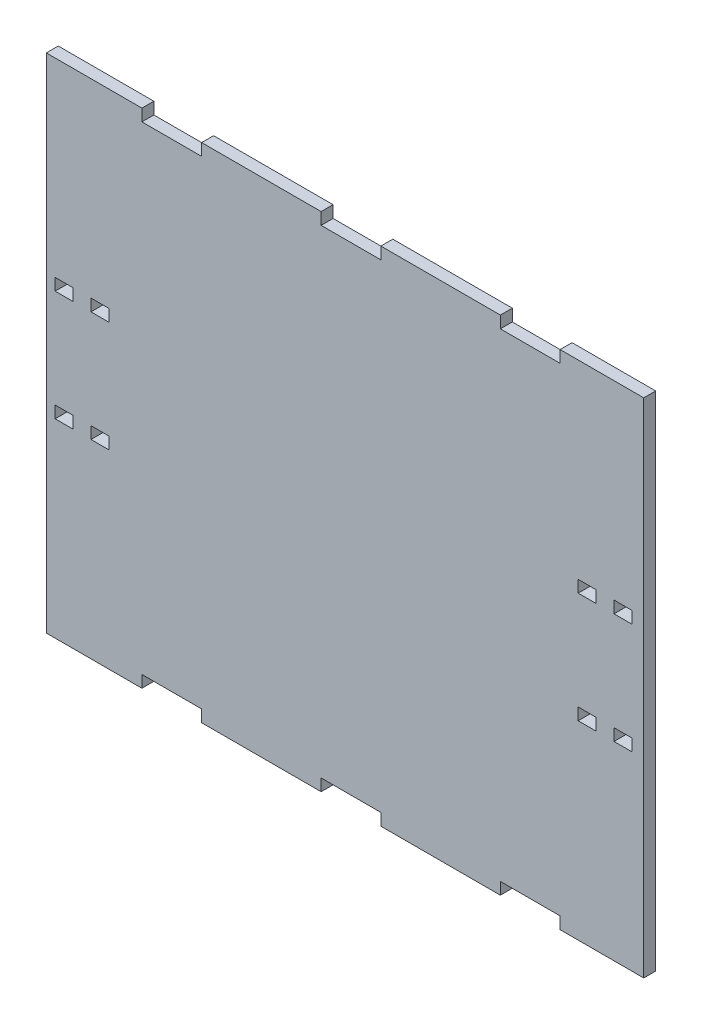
ISO-10303-21;
HEADER;
FILE_DESCRIPTION(('STEP AP214'),'2;1');
FILE_NAME('part.step','',(''),(''),'','','');
FILE_SCHEMA(('AUTOMOTIVE_DESIGN { 1 0 10303 214 1 1 1 1 }'));
ENDSEC;
DATA;
#1=APPLICATION_CONTEXT('core data for automotive mechanical design processes');
#2=APPLICATION_PROTOCOL_DEFINITION('international standard','automotive_design',2000,#1);
#3=PRODUCT_CONTEXT('',#1,'mechanical');
#4=PRODUCT('Part','Part','',(#3));
#5=PRODUCT_RELATED_PRODUCT_CATEGORY('part','',(#4));
#6=PRODUCT_DEFINITION_FORMATION('','',#4);
#7=PRODUCT_DEFINITION_CONTEXT('part definition',#1,'design');
#8=PRODUCT_DEFINITION('design','',#6,#7);
#9=PRODUCT_DEFINITION_SHAPE('','',#8);
#10=(LENGTH_UNIT() NAMED_UNIT(*) SI_UNIT(.MILLI.,.METRE.));
#11=(NAMED_UNIT(*) PLANE_ANGLE_UNIT() SI_UNIT($,.RADIAN.));
#12=(NAMED_UNIT(*) SI_UNIT($,.STERADIAN.) SOLID_ANGLE_UNIT());
#13=UNCERTAINTY_MEASURE_WITH_UNIT(LENGTH_MEASURE(1.E-05),#10,'distance_accuracy_value','');
#14=(GEOMETRIC_REPRESENTATION_CONTEXT(3) GLOBAL_UNCERTAINTY_ASSIGNED_CONTEXT((#13)) GLOBAL_UNIT_ASSIGNED_CONTEXT((#10,
#11,#12)) REPRESENTATION_CONTEXT('',''));
#15=CARTESIAN_POINT('',(0.,0.,0.));
#16=DIRECTION('',(0.,0.,1.));
#17=DIRECTION('',(1.,0.,0.));
#18=AXIS2_PLACEMENT_3D('',#15,#16,#17);
#19=CARTESIAN_POINT('',(-500.,-420.5,20.));
#20=DIRECTION('',(0.,1.,0.));
#21=DIRECTION('',(0.,0.,1.));
#22=AXIS2_PLACEMENT_3D('',#19,#20,#21);
#23=PLANE('',#22);
#24=DIRECTION('',(1.,0.,0.));
#25=VECTOR('',#24,1.);
#26=CARTESIAN_POINT('',(-500.,-420.5,0.));
#27=LINE('',#26,#25);
#28=CARTESIAN_POINT('',(60.0000000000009,-420.5,0.));
#29=VERTEX_POINT('',#28);
#30=CARTESIAN_POINT('',(260.000000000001,-420.5,0.));
#31=VERTEX_POINT('',#30);
#32=EDGE_CURVE('E1168',#29,#31,#27,.T.);
#33=ORIENTED_EDGE('',*,*,#32,.T.);
#34=DIRECTION('',(0.,0.,-1.));
#35=VECTOR('',#34,1.);
#36=CARTESIAN_POINT('',(260.000000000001,-420.5,20.));
#37=LINE('',#36,#35);
#38=CARTESIAN_POINT('',(260.000000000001,-420.5,20.));
#39=VERTEX_POINT('',#38);
#40=EDGE_CURVE('E450',#39,#31,#37,.T.);
#41=ORIENTED_EDGE('',*,*,#40,.F.);
#42=DIRECTION('',(1.,0.,0.));
#43=VECTOR('',#42,1.);
#44=CARTESIAN_POINT('',(-500.,-420.5,20.));
#45=LINE('',#44,#43);
#46=CARTESIAN_POINT('',(60.0000000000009,-420.5,20.));
#47=VERTEX_POINT('',#46);
#48=EDGE_CURVE('E442',#47,#39,#45,.T.);
#49=ORIENTED_EDGE('',*,*,#48,.F.);
#50=DIRECTION('',(0.,0.,-1.));
#51=VECTOR('',#50,1.);
#52=CARTESIAN_POINT('',(60.0000000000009,-420.5,20.));
#53=LINE('',#52,#51);
#54=EDGE_CURVE('E499',#47,#29,#53,.T.);
#55=ORIENTED_EDGE('',*,*,#54,.T.);
#56=EDGE_LOOP('',(#33,#41,#49,#55));
#57=FACE_BOUND('',#56,.T.);
#58=ADVANCED_FACE('F40',(#57),#23,.F.);
#59=CARTESIAN_POINT('',(-500.,420.5,20.));
#60=DIRECTION('',(0.,-1.,0.));
#61=DIRECTION('',(0.,0.,-1.));
#62=AXIS2_PLACEMENT_3D('',#59,#60,#61);
#63=PLANE('',#62);
#64=DIRECTION('',(-1.,0.,0.));
#65=VECTOR('',#64,1.);
#66=CARTESIAN_POINT('',(-500.,420.5,20.));
#67=LINE('',#66,#65);
#68=CARTESIAN_POINT('',(260.000000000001,420.5,20.));
#69=VERTEX_POINT('',#68);
#70=CARTESIAN_POINT('',(60.0000000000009,420.5,20.));
#71=VERTEX_POINT('',#70);
#72=EDGE_CURVE('E1037',#69,#71,#67,.T.);
#73=ORIENTED_EDGE('',*,*,#72,.F.);
#74=DIRECTION('',(0.,0.,-1.));
#75=VECTOR('',#74,1.);
#76=CARTESIAN_POINT('',(260.000000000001,420.5,20.));
#77=LINE('',#76,#75);
#78=CARTESIAN_POINT('',(260.000000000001,420.5,0.));
#79=VERTEX_POINT('',#78);
#80=EDGE_CURVE('E464',#69,#79,#77,.T.);
#81=ORIENTED_EDGE('',*,*,#80,.T.);
#82=DIRECTION('',(-1.,0.,0.));
#83=VECTOR('',#82,1.);
#84=CARTESIAN_POINT('',(-500.,420.5,0.));
#85=LINE('',#84,#83);
#86=CARTESIAN_POINT('',(60.0000000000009,420.5,0.));
#87=VERTEX_POINT('',#86);
#88=EDGE_CURVE('E1052',#79,#87,#85,.T.);
#89=ORIENTED_EDGE('',*,*,#88,.T.);
#90=DIRECTION('',(0.,0.,-1.));
#91=VECTOR('',#90,1.);
#92=CARTESIAN_POINT('',(60.0000000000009,420.5,20.));
#93=LINE('',#92,#91);
#94=EDGE_CURVE('E527',#71,#87,#93,.T.);
#95=ORIENTED_EDGE('',*,*,#94,.F.);
#96=EDGE_LOOP('',(#73,#81,#89,#95));
#97=FACE_BOUND('',#96,.T.);
#98=ADVANCED_FACE('F1099',(#97),#63,.F.);
#99=CARTESIAN_POINT('',(-239.999999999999,-420.5,0.));
#100=VERTEX_POINT('',#99);
#101=CARTESIAN_POINT('',(-39.999999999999,-420.5,0.));
#102=VERTEX_POINT('',#101);
#103=EDGE_CURVE('E1059',#100,#102,#27,.T.);
#104=ORIENTED_EDGE('',*,*,#103,.T.);
#105=DIRECTION('',(0.,0.,-1.));
#106=VECTOR('',#105,1.);
#107=CARTESIAN_POINT('',(-39.999999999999,-420.5,20.));
#108=LINE('',#107,#106);
#109=CARTESIAN_POINT('',(-39.999999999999,-420.5,20.));
#110=VERTEX_POINT('',#109);
#111=EDGE_CURVE('E496',#110,#102,#108,.T.);
#112=ORIENTED_EDGE('',*,*,#111,.F.);
#113=CARTESIAN_POINT('',(-239.999999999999,-420.5,20.));
#114=VERTEX_POINT('',#113);
#115=EDGE_CURVE('E1045',#114,#110,#45,.T.);
#116=ORIENTED_EDGE('',*,*,#115,.F.);
#117=DIRECTION('',(0.,0.,-1.));
#118=VECTOR('',#117,1.);
#119=CARTESIAN_POINT('',(-239.999999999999,-420.5,20.));
#120=LINE('',#119,#118);
#121=EDGE_CURVE('E552',#114,#100,#120,.T.);
#122=ORIENTED_EDGE('',*,*,#121,.T.);
#123=EDGE_LOOP('',(#104,#112,#116,#122));
#124=FACE_BOUND('',#123,.T.);
#125=ADVANCED_FACE('F1121',(#124),#23,.F.);
#126=CARTESIAN_POINT('',(-39.9999999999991,420.5,20.));
#127=VERTEX_POINT('',#126);
#128=CARTESIAN_POINT('',(-239.999999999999,420.5,20.));
#129=VERTEX_POINT('',#128);
#130=EDGE_CURVE('E1112',#127,#129,#67,.T.);
#131=ORIENTED_EDGE('',*,*,#130,.F.);
#132=DIRECTION('',(0.,0.,-1.));
#133=VECTOR('',#132,1.);
#134=CARTESIAN_POINT('',(-39.9999999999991,420.5,20.));
#135=LINE('',#134,#133);
#136=CARTESIAN_POINT('',(-39.9999999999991,420.5,0.));
#137=VERTEX_POINT('',#136);
#138=EDGE_CURVE('E515',#127,#137,#135,.T.);
#139=ORIENTED_EDGE('',*,*,#138,.T.);
#140=CARTESIAN_POINT('',(-239.999999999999,420.5,0.));
#141=VERTEX_POINT('',#140);
#142=EDGE_CURVE('E1091',#137,#141,#85,.T.);
#143=ORIENTED_EDGE('',*,*,#142,.T.);
#144=DIRECTION('',(0.,0.,-1.));
#145=VECTOR('',#144,1.);
#146=CARTESIAN_POINT('',(-239.999999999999,420.5,20.));
#147=LINE('',#146,#145);
#148=EDGE_CURVE('E580',#129,#141,#147,.T.);
#149=ORIENTED_EDGE('',*,*,#148,.F.);
#150=EDGE_LOOP('',(#131,#139,#143,#149));
#151=FACE_BOUND('',#150,.T.);
#152=ADVANCED_FACE('F1119',(#151),#63,.F.);
#153=CARTESIAN_POINT('',(-500.,-420.5,0.));
#154=VERTEX_POINT('',#153);
#155=CARTESIAN_POINT('',(-339.999999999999,-420.5,0.));
#156=VERTEX_POINT('',#155);
#157=EDGE_CURVE('E1055',#154,#156,#27,.T.);
#158=ORIENTED_EDGE('',*,*,#157,.T.);
#159=DIRECTION('',(0.,0.,-1.));
#160=VECTOR('',#159,1.);
#161=CARTESIAN_POINT('',(-339.999999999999,-420.5,20.));
#162=LINE('',#161,#160);
#163=CARTESIAN_POINT('',(-339.999999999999,-420.5,20.));
#164=VERTEX_POINT('',#163);
#165=EDGE_CURVE('E549',#164,#156,#162,.T.);
#166=ORIENTED_EDGE('',*,*,#165,.F.);
#167=CARTESIAN_POINT('',(-500.,-420.5,20.));
#168=VERTEX_POINT('',#167);
#169=EDGE_CURVE('E1041',#168,#164,#45,.T.);
#170=ORIENTED_EDGE('',*,*,#169,.F.);
#171=DIRECTION('',(0.,0.,-1.));
#172=VECTOR('',#171,1.);
#173=CARTESIAN_POINT('',(-500.,-420.5,20.));
#174=LINE('',#173,#172);
#175=EDGE_CURVE('E48',#168,#154,#174,.T.);
#176=ORIENTED_EDGE('',*,*,#175,.T.);
#177=EDGE_LOOP('',(#158,#166,#170,#176));
#178=FACE_BOUND('',#177,.T.);
#179=ADVANCED_FACE('F1070',(#178),#23,.F.);
#180=CARTESIAN_POINT('',(-339.999999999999,420.5,20.));
#181=VERTEX_POINT('',#180);
#182=CARTESIAN_POINT('',(-500.,420.5,20.));
#183=VERTEX_POINT('',#182);
#184=EDGE_CURVE('E1038',#181,#183,#67,.T.);
#185=ORIENTED_EDGE('',*,*,#184,.F.);
#186=DIRECTION('',(0.,0.,-1.));
#187=VECTOR('',#186,1.);
#188=CARTESIAN_POINT('',(-339.999999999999,420.5,20.));
#189=LINE('',#188,#187);
#190=CARTESIAN_POINT('',(-339.999999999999,420.5,0.));
#191=VERTEX_POINT('',#190);
#192=EDGE_CURVE('E568',#181,#191,#189,.T.);
#193=ORIENTED_EDGE('',*,*,#192,.T.);
#194=CARTESIAN_POINT('',(-500.,420.5,0.));
#195=VERTEX_POINT('',#194);
#196=EDGE_CURVE('E991',#191,#195,#85,.T.);
#197=ORIENTED_EDGE('',*,*,#196,.T.);
#198=DIRECTION('',(0.,0.,-1.));
#199=VECTOR('',#198,1.);
#200=CARTESIAN_POINT('',(-500.,420.5,20.));
#201=LINE('',#200,#199);
#202=EDGE_CURVE('E12',#183,#195,#201,.T.);
#203=ORIENTED_EDGE('',*,*,#202,.F.);
#204=EDGE_LOOP('',(#185,#193,#197,#203));
#205=FACE_BOUND('',#204,.T.);
#206=ADVANCED_FACE('F1089',(#205),#63,.F.);
#207=CARTESIAN_POINT('',(0.,0.,20.));
#208=DIRECTION('',(0.,0.,1.));
#209=DIRECTION('',(1.,0.,0.));
#210=AXIS2_PLACEMENT_3D('',#207,#208,#209);
#211=PLANE('',#210);
#212=DIRECTION('',(0.,1.,0.));
#213=VECTOR('',#212,1.);
#214=CARTESIAN_POINT('',(260.000000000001,-400.500000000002,20.));
#215=LINE('',#214,#213);
#216=CARTESIAN_POINT('',(260.000000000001,-400.500000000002,20.));
#217=VERTEX_POINT('',#216);
#218=EDGE_CURVE('E420',#39,#217,#215,.T.);
#219=ORIENTED_EDGE('',*,*,#218,.T.);
#220=DIRECTION('',(1.,0.,0.));
#221=VECTOR('',#220,1.);
#222=CARTESIAN_POINT('',(260.000000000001,-400.500000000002,20.));
#223=LINE('',#222,#221);
#224=CARTESIAN_POINT('',(360.000000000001,-400.500000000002,20.));
#225=VERTEX_POINT('',#224);
#226=EDGE_CURVE('E431',#217,#225,#223,.T.);
#227=ORIENTED_EDGE('',*,*,#226,.T.);
#228=DIRECTION('',(0.,-1.,0.));
#229=VECTOR('',#228,1.);
#230=CARTESIAN_POINT('',(360.000000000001,-400.500000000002,20.));
#231=LINE('',#230,#229);
#232=CARTESIAN_POINT('',(360.000000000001,-420.5,20.));
#233=VERTEX_POINT('',#232);
#234=EDGE_CURVE('E428',#225,#233,#231,.T.);
#235=ORIENTED_EDGE('',*,*,#234,.T.);
#236=CARTESIAN_POINT('',(500.,-420.5,20.));
#237=VERTEX_POINT('',#236);
#238=EDGE_CURVE('E1040',#233,#237,#45,.T.);
#239=ORIENTED_EDGE('',*,*,#238,.T.);
#240=DIRECTION('',(0.,1.,0.));
#241=VECTOR('',#240,1.);
#242=CARTESIAN_POINT('',(500.,-420.5,20.));
#243=LINE('',#242,#241);
#244=CARTESIAN_POINT('',(500.,420.5,20.));
#245=VERTEX_POINT('',#244);
#246=EDGE_CURVE('E1044',#237,#245,#243,.T.);
#247=ORIENTED_EDGE('',*,*,#246,.T.);
#248=CARTESIAN_POINT('',(360.000000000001,420.5,20.));
#249=VERTEX_POINT('',#248);
#250=EDGE_CURVE('E1033',#245,#249,#67,.T.);
#251=ORIENTED_EDGE('',*,*,#250,.T.);
#252=DIRECTION('',(0.,-1.,0.));
#253=VECTOR('',#252,1.);
#254=CARTESIAN_POINT('',(360.000000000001,420.5,20.));
#255=LINE('',#254,#253);
#256=CARTESIAN_POINT('',(360.000000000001,400.509999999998,20.));
#257=VERTEX_POINT('',#256);
#258=EDGE_CURVE('E63',#249,#257,#255,.T.);
#259=ORIENTED_EDGE('',*,*,#258,.T.);
#260=DIRECTION('',(-1.,0.,0.));
#261=VECTOR('',#260,1.);
#262=CARTESIAN_POINT('',(260.000000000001,400.509999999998,20.));
#263=LINE('',#262,#261);
#264=CARTESIAN_POINT('',(260.000000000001,400.509999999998,20.));
#265=VERTEX_POINT('',#264);
#266=EDGE_CURVE('E461',#257,#265,#263,.T.);
#267=ORIENTED_EDGE('',*,*,#266,.T.);
#268=DIRECTION('',(0.,1.,0.));
#269=VECTOR('',#268,1.);
#270=CARTESIAN_POINT('',(260.000000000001,420.5,20.));
#271=LINE('',#270,#269);
#272=EDGE_CURVE('E456',#265,#69,#271,.T.);
#273=ORIENTED_EDGE('',*,*,#272,.T.);
#274=ORIENTED_EDGE('',*,*,#72,.T.);
#275=DIRECTION('',(0.,-1.,0.));
#276=VECTOR('',#275,1.);
#277=CARTESIAN_POINT('',(60.0000000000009,420.5,20.));
#278=LINE('',#277,#276);
#279=CARTESIAN_POINT('',(60.0000000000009,400.509999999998,20.));
#280=VERTEX_POINT('',#279);
#281=EDGE_CURVE('E508',#71,#280,#278,.T.);
#282=ORIENTED_EDGE('',*,*,#281,.T.);
#283=DIRECTION('',(-1.,0.,0.));
#284=VECTOR('',#283,1.);
#285=CARTESIAN_POINT('',(-39.9999999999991,400.509999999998,20.));
#286=LINE('',#285,#284);
#287=CARTESIAN_POINT('',(-39.9999999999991,400.509999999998,20.));
#288=VERTEX_POINT('',#287);
#289=EDGE_CURVE('E512',#280,#288,#286,.T.);
#290=ORIENTED_EDGE('',*,*,#289,.T.);
#291=DIRECTION('',(0.,1.,0.));
#292=VECTOR('',#291,1.);
#293=CARTESIAN_POINT('',(-39.9999999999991,420.5,20.));
#294=LINE('',#293,#292);
#295=EDGE_CURVE('E505',#288,#127,#294,.T.);
#296=ORIENTED_EDGE('',*,*,#295,.T.);
#297=ORIENTED_EDGE('',*,*,#130,.T.);
#298=DIRECTION('',(0.,-1.,0.));
#299=VECTOR('',#298,1.);
#300=CARTESIAN_POINT('',(-239.999999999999,420.5,20.));
#301=LINE('',#300,#299);
#302=CARTESIAN_POINT('',(-239.999999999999,400.509999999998,20.));
#303=VERTEX_POINT('',#302);
#304=EDGE_CURVE('E561',#129,#303,#301,.T.);
#305=ORIENTED_EDGE('',*,*,#304,.T.);
#306=DIRECTION('',(-1.,0.,0.));
#307=VECTOR('',#306,1.);
#308=CARTESIAN_POINT('',(-339.999999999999,400.509999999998,20.));
#309=LINE('',#308,#307);
#310=CARTESIAN_POINT('',(-339.999999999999,400.509999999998,20.));
#311=VERTEX_POINT('',#310);
#312=EDGE_CURVE('E565',#303,#311,#309,.T.);
#313=ORIENTED_EDGE('',*,*,#312,.T.);
#314=DIRECTION('',(0.,1.,0.));
#315=VECTOR('',#314,1.);
#316=CARTESIAN_POINT('',(-339.999999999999,420.5,20.));
#317=LINE('',#316,#315);
#318=EDGE_CURVE('E558',#311,#181,#317,.T.);
#319=ORIENTED_EDGE('',*,*,#318,.T.);
#320=ORIENTED_EDGE('',*,*,#184,.T.);
#321=DIRECTION('',(0.,-1.,0.));
#322=VECTOR('',#321,1.);
#323=CARTESIAN_POINT('',(-500.,-420.5,20.));
#324=LINE('',#323,#322);
#325=EDGE_CURVE('E1036',#183,#168,#324,.T.);
#326=ORIENTED_EDGE('',*,*,#325,.T.);
#327=ORIENTED_EDGE('',*,*,#169,.T.);
#328=DIRECTION('',(0.,1.,0.));
#329=VECTOR('',#328,1.);
#330=CARTESIAN_POINT('',(-339.999999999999,-400.500000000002,20.));
#331=LINE('',#330,#329);
#332=CARTESIAN_POINT('',(-339.999999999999,-400.500000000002,20.));
#333=VERTEX_POINT('',#332);
#334=EDGE_CURVE('E532',#164,#333,#331,.T.);
#335=ORIENTED_EDGE('',*,*,#334,.T.);
#336=DIRECTION('',(1.,0.,0.));
#337=VECTOR('',#336,1.);
#338=CARTESIAN_POINT('',(-339.999999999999,-400.500000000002,20.));
#339=LINE('',#338,#337);
#340=CARTESIAN_POINT('',(-239.999999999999,-400.500000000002,20.));
#341=VERTEX_POINT('',#340);
#342=EDGE_CURVE('E535',#333,#341,#339,.T.);
#343=ORIENTED_EDGE('',*,*,#342,.T.);
#344=DIRECTION('',(0.,-1.,0.));
#345=VECTOR('',#344,1.);
#346=CARTESIAN_POINT('',(-239.999999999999,-400.500000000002,20.));
#347=LINE('',#346,#345);
#348=EDGE_CURVE('E539',#341,#114,#347,.T.);
#349=ORIENTED_EDGE('',*,*,#348,.T.);
#350=ORIENTED_EDGE('',*,*,#115,.T.);
#351=DIRECTION('',(0.,1.,0.));
#352=VECTOR('',#351,1.);
#353=CARTESIAN_POINT('',(-39.999999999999,-400.500000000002,20.));
#354=LINE('',#353,#352);
#355=CARTESIAN_POINT('',(-39.999999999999,-400.500000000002,20.));
#356=VERTEX_POINT('',#355);
#357=EDGE_CURVE('E480',#110,#356,#354,.T.);
#358=ORIENTED_EDGE('',*,*,#357,.T.);
#359=DIRECTION('',(1.,0.,0.));
#360=VECTOR('',#359,1.);
#361=CARTESIAN_POINT('',(-39.999999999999,-400.500000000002,20.));
#362=LINE('',#361,#360);
#363=CARTESIAN_POINT('',(60.0000000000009,-400.500000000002,20.));
#364=VERTEX_POINT('',#363);
#365=EDGE_CURVE('E483',#356,#364,#362,.T.);
#366=ORIENTED_EDGE('',*,*,#365,.T.);
#367=DIRECTION('',(0.,-1.,0.));
#368=VECTOR('',#367,1.);
#369=CARTESIAN_POINT('',(60.0000000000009,-400.500000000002,20.));
#370=LINE('',#369,#368);
#371=EDGE_CURVE('E487',#364,#47,#370,.T.);
#372=ORIENTED_EDGE('',*,*,#371,.T.);
#373=ORIENTED_EDGE('',*,*,#48,.T.);
#374=EDGE_LOOP('',(#219,#227,#235,#239,#247,#251,#259,#267,#273,#274,#282,#290,#296,#297,#305,
#313,#319,#320,#326,#327,#335,#343,#349,#350,#358,#366,#372,#373));
#375=FACE_BOUND('',#374,.T.);
#376=DIRECTION('',(1.,0.,0.));
#377=VECTOR('',#376,1.);
#378=CARTESIAN_POINT('',(-425.23244311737,-102.498590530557,20.));
#379=LINE('',#378,#377);
#380=CARTESIAN_POINT('',(-425.23244311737,-102.498590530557,20.));
#381=VERTEX_POINT('',#380);
#382=CARTESIAN_POINT('',(-395.232443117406,-102.498590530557,20.));
#383=VERTEX_POINT('',#382);
#384=EDGE_CURVE('E577',#381,#383,#379,.T.);
#385=ORIENTED_EDGE('',*,*,#384,.F.);
#386=DIRECTION('',(0.,-1.,0.));
#387=VECTOR('',#386,1.);
#388=CARTESIAN_POINT('',(-425.23244311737,-82.4985905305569,20.));
#389=LINE('',#388,#387);
#390=CARTESIAN_POINT('',(-425.23244311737,-82.4985905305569,20.));
#391=VERTEX_POINT('',#390);
#392=EDGE_CURVE('E587',#391,#381,#389,.T.);
#393=ORIENTED_EDGE('',*,*,#392,.F.);
#394=DIRECTION('',(-1.,0.,0.));
#395=VECTOR('',#394,1.);
#396=CARTESIAN_POINT('',(-395.232443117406,-82.4985905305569,20.));
#397=LINE('',#396,#395);
#398=CARTESIAN_POINT('',(-395.232443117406,-82.4985905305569,20.));
#399=VERTEX_POINT('',#398);
#400=EDGE_CURVE('E607',#399,#391,#397,.T.);
#401=ORIENTED_EDGE('',*,*,#400,.F.);
#402=DIRECTION('',(0.,1.,0.));
#403=VECTOR('',#402,1.);
#404=CARTESIAN_POINT('',(-395.232443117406,-102.498590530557,20.));
#405=LINE('',#404,#403);
#406=EDGE_CURVE('E600',#383,#399,#405,.T.);
#407=ORIENTED_EDGE('',*,*,#406,.F.);
#408=EDGE_LOOP('',(#385,#393,#401,#407));
#409=FACE_BOUND('',#408,.T.);
#410=DIRECTION('',(-1.,0.,0.));
#411=VECTOR('',#410,1.);
#412=CARTESIAN_POINT('',(-455.232443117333,-82.498590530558,20.));
#413=LINE('',#412,#411);
#414=CARTESIAN_POINT('',(-455.232443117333,-82.498590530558,20.));
#415=VERTEX_POINT('',#414);
#416=CARTESIAN_POINT('',(-485.232443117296,-82.498590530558,20.));
#417=VERTEX_POINT('',#416);
#418=EDGE_CURVE('E599',#415,#417,#413,.T.);
#419=ORIENTED_EDGE('',*,*,#418,.F.);
#420=DIRECTION('',(0.,1.,0.));
#421=VECTOR('',#420,1.);
#422=CARTESIAN_POINT('',(-455.232443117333,-102.498590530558,20.));
#423=LINE('',#422,#421);
#424=CARTESIAN_POINT('',(-455.232443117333,-102.498590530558,20.));
#425=VERTEX_POINT('',#424);
#426=EDGE_CURVE('E643',#425,#415,#423,.T.);
#427=ORIENTED_EDGE('',*,*,#426,.F.);
#428=DIRECTION('',(1.,0.,0.));
#429=VECTOR('',#428,1.);
#430=CARTESIAN_POINT('',(-485.232443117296,-102.498590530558,20.));
#431=LINE('',#430,#429);
#432=CARTESIAN_POINT('',(-485.232443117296,-102.498590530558,20.));
#433=VERTEX_POINT('',#432);
#434=EDGE_CURVE('E663',#433,#425,#431,.T.);
#435=ORIENTED_EDGE('',*,*,#434,.F.);
#436=DIRECTION('',(0.,-1.,0.));
#437=VECTOR('',#436,1.);
#438=CARTESIAN_POINT('',(-485.232443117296,-82.498590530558,20.));
#439=LINE('',#438,#437);
#440=EDGE_CURVE('E656',#417,#433,#439,.T.);
#441=ORIENTED_EDGE('',*,*,#440,.F.);
#442=EDGE_LOOP('',(#419,#427,#435,#441));
#443=FACE_BOUND('',#442,.T.);
#444=DIRECTION('',(-1.,0.,0.));
#445=VECTOR('',#444,1.);
#446=CARTESIAN_POINT('',(480.263874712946,102.507833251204,19.9999999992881));
#447=LINE('',#446,#445);
#448=CARTESIAN_POINT('',(480.263874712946,102.507833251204,19.9999999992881));
#449=VERTEX_POINT('',#448);
#450=CARTESIAN_POINT('',(450.263874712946,102.507833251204,20.));
#451=VERTEX_POINT('',#450);
#452=EDGE_CURVE('E655',#449,#451,#447,.T.);
#453=ORIENTED_EDGE('',*,*,#452,.F.);
#454=DIRECTION('',(0.,1.,0.));
#455=VECTOR('',#454,1.);
#456=CARTESIAN_POINT('',(480.263874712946,82.507833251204,19.9999999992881));
#457=LINE('',#456,#455);
#458=CARTESIAN_POINT('',(480.263874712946,82.507833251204,19.9999999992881));
#459=VERTEX_POINT('',#458);
#460=EDGE_CURVE('E699',#459,#449,#457,.T.);
#461=ORIENTED_EDGE('',*,*,#460,.F.);
#462=DIRECTION('',(1.,0.,0.));
#463=VECTOR('',#462,1.);
#464=CARTESIAN_POINT('',(450.263874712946,82.5078332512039,19.9999999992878));
#465=LINE('',#464,#463);
#466=CARTESIAN_POINT('',(450.263874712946,82.5078332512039,19.9999999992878));
#467=VERTEX_POINT('',#466);
#468=EDGE_CURVE('E719',#467,#459,#465,.T.);
#469=ORIENTED_EDGE('',*,*,#468,.F.);
#470=DIRECTION('',(0.,-1.,0.));
#471=VECTOR('',#470,1.);
#472=CARTESIAN_POINT('',(450.263874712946,102.507833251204,19.9999999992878));
#473=LINE('',#472,#471);
#474=EDGE_CURVE('E712',#451,#467,#473,.T.);
#475=ORIENTED_EDGE('',*,*,#474,.F.);
#476=EDGE_LOOP('',(#453,#461,#469,#475));
#477=FACE_BOUND('',#476,.T.);
#478=DIRECTION('',(1.,0.,0.));
#479=VECTOR('',#478,1.);
#480=CARTESIAN_POINT('',(420.263874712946,82.5078332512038,19.9999999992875));
#481=LINE('',#480,#479);
#482=CARTESIAN_POINT('',(390.263874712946,82.5078332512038,19.9999999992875));
#483=VERTEX_POINT('',#482);
#484=CARTESIAN_POINT('',(420.263874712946,82.5078332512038,20.));
#485=VERTEX_POINT('',#484);
#486=EDGE_CURVE('E711',#483,#485,#481,.T.);
#487=ORIENTED_EDGE('',*,*,#486,.F.);
#488=DIRECTION('',(0.,-1.,0.));
#489=VECTOR('',#488,1.);
#490=CARTESIAN_POINT('',(390.263874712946,82.5078332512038,19.9999999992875));
#491=LINE('',#490,#489);
#492=CARTESIAN_POINT('',(390.263874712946,102.507833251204,19.9999999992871));
#493=VERTEX_POINT('',#492);
#494=EDGE_CURVE('E755',#493,#483,#491,.T.);
#495=ORIENTED_EDGE('',*,*,#494,.F.);
#496=DIRECTION('',(-1.,0.,0.));
#497=VECTOR('',#496,1.);
#498=CARTESIAN_POINT('',(420.263874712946,102.507833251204,19.9999999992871));
#499=LINE('',#498,#497);
#500=CARTESIAN_POINT('',(420.263874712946,102.507833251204,19.9999999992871));
#501=VERTEX_POINT('',#500);
#502=EDGE_CURVE('E775',#501,#493,#499,.T.);
#503=ORIENTED_EDGE('',*,*,#502,.F.);
#504=DIRECTION('',(0.,1.,0.));
#505=VECTOR('',#504,1.);
#506=CARTESIAN_POINT('',(420.263874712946,82.5078332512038,19.9999999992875));
#507=LINE('',#506,#505);
#508=EDGE_CURVE('E768',#485,#501,#507,.T.);
#509=ORIENTED_EDGE('',*,*,#508,.F.);
#510=EDGE_LOOP('',(#487,#495,#503,#509));
#511=FACE_BOUND('',#510,.T.);
#512=DIRECTION('',(1.,0.,0.));
#513=VECTOR('',#512,1.);
#514=CARTESIAN_POINT('',(390.263874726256,-102.498590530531,20.));
#515=LINE('',#514,#513);
#516=CARTESIAN_POINT('',(390.263874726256,-102.498590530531,20.));
#517=VERTEX_POINT('',#516);
#518=CARTESIAN_POINT('',(420.263874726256,-102.498590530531,20.));
#519=VERTEX_POINT('',#518);
#520=EDGE_CURVE('E767',#517,#519,#515,.T.);
#521=ORIENTED_EDGE('',*,*,#520,.F.);
#522=DIRECTION('',(0.,-1.,0.));
#523=VECTOR('',#522,1.);
#524=CARTESIAN_POINT('',(390.263874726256,-82.4985905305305,20.));
#525=LINE('',#524,#523);
#526=CARTESIAN_POINT('',(390.263874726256,-82.4985905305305,20.));
#527=VERTEX_POINT('',#526);
#528=EDGE_CURVE('E811',#527,#517,#525,.T.);
#529=ORIENTED_EDGE('',*,*,#528,.F.);
#530=DIRECTION('',(-1.,0.,0.));
#531=VECTOR('',#530,1.);
#532=CARTESIAN_POINT('',(420.263874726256,-82.4985905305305,20.));
#533=LINE('',#532,#531);
#534=CARTESIAN_POINT('',(420.263874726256,-82.4985905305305,20.));
#535=VERTEX_POINT('',#534);
#536=EDGE_CURVE('E831',#535,#527,#533,.T.);
#537=ORIENTED_EDGE('',*,*,#536,.F.);
#538=DIRECTION('',(0.,1.,0.));
#539=VECTOR('',#538,1.);
#540=CARTESIAN_POINT('',(420.263874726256,-102.498590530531,20.));
#541=LINE('',#540,#539);
#542=EDGE_CURVE('E824',#519,#535,#541,.T.);
#543=ORIENTED_EDGE('',*,*,#542,.F.);
#544=EDGE_LOOP('',(#521,#529,#537,#543));
#545=FACE_BOUND('',#544,.T.);
#546=DIRECTION('',(0.,-1.,0.));
#547=VECTOR('',#546,1.);
#548=CARTESIAN_POINT('',(-395.232443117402,82.5078332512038,20.));
#549=LINE('',#548,#547);
#550=CARTESIAN_POINT('',(-395.232443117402,102.507833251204,20.));
#551=VERTEX_POINT('',#550);
#552=CARTESIAN_POINT('',(-395.232443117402,82.5078332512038,20.));
#553=VERTEX_POINT('',#552);
#554=EDGE_CURVE('E923',#551,#553,#549,.T.);
#555=ORIENTED_EDGE('',*,*,#554,.T.);
#556=DIRECTION('',(-1.,0.,0.));
#557=VECTOR('',#556,1.);
#558=CARTESIAN_POINT('',(-395.232443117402,82.5078332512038,20.));
#559=LINE('',#558,#557);
#560=CARTESIAN_POINT('',(-425.232443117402,82.5078332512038,20.));
#561=VERTEX_POINT('',#560);
#562=EDGE_CURVE('E878',#553,#561,#559,.T.);
#563=ORIENTED_EDGE('',*,*,#562,.T.);
#564=DIRECTION('',(0.,1.,0.));
#565=VECTOR('',#564,1.);
#566=CARTESIAN_POINT('',(-425.232443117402,82.5078332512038,20.));
#567=LINE('',#566,#565);
#568=CARTESIAN_POINT('',(-425.232443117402,102.507833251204,20.));
#569=VERTEX_POINT('',#568);
#570=EDGE_CURVE('E935',#561,#569,#567,.T.);
#571=ORIENTED_EDGE('',*,*,#570,.T.);
#572=DIRECTION('',(1.,0.,0.));
#573=VECTOR('',#572,1.);
#574=CARTESIAN_POINT('',(-395.232443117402,102.507833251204,20.));
#575=LINE('',#574,#573);
#576=EDGE_CURVE('E942',#569,#551,#575,.T.);
#577=ORIENTED_EDGE('',*,*,#576,.T.);
#578=EDGE_LOOP('',(#555,#563,#571,#577));
#579=FACE_BOUND('',#578,.T.);
#580=DIRECTION('',(1.,0.,0.));
#581=VECTOR('',#580,1.);
#582=CARTESIAN_POINT('',(450.263874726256,-102.49859053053,20.));
#583=LINE('',#582,#581);
#584=CARTESIAN_POINT('',(450.263874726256,-102.49859053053,20.));
#585=VERTEX_POINT('',#584);
#586=CARTESIAN_POINT('',(480.263874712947,-102.49859053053,20.));
#587=VERTEX_POINT('',#586);
#588=EDGE_CURVE('E934',#585,#587,#583,.T.);
#589=ORIENTED_EDGE('',*,*,#588,.F.);
#590=DIRECTION('',(0.,-1.,0.));
#591=VECTOR('',#590,1.);
#592=CARTESIAN_POINT('',(450.263874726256,-82.4985905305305,20.));
#593=LINE('',#592,#591);
#594=CARTESIAN_POINT('',(450.263874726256,-82.4985905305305,20.));
#595=VERTEX_POINT('',#594);
#596=EDGE_CURVE('E979',#595,#585,#593,.T.);
#597=ORIENTED_EDGE('',*,*,#596,.F.);
#598=DIRECTION('',(-1.,0.,0.));
#599=VECTOR('',#598,1.);
#600=CARTESIAN_POINT('',(480.263874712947,-82.4985905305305,20.));
#601=LINE('',#600,#599);
#602=CARTESIAN_POINT('',(480.263874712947,-82.4985905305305,20.));
#603=VERTEX_POINT('',#602);
#604=EDGE_CURVE('E999',#603,#595,#601,.T.);
#605=ORIENTED_EDGE('',*,*,#604,.F.);
#606=DIRECTION('',(0.,1.,0.));
#607=VECTOR('',#606,1.);
#608=CARTESIAN_POINT('',(480.263874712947,-102.49859053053,20.));
#609=LINE('',#608,#607);
#610=EDGE_CURVE('E992',#587,#603,#609,.T.);
#611=ORIENTED_EDGE('',*,*,#610,.F.);
#612=EDGE_LOOP('',(#589,#597,#605,#611));
#613=FACE_BOUND('',#612,.T.);
#614=DIRECTION('',(0.,1.,0.));
#615=VECTOR('',#614,1.);
#616=CARTESIAN_POINT('',(-485.232443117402,102.507833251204,20.));
#617=LINE('',#616,#615);
#618=CARTESIAN_POINT('',(-485.232443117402,82.5078332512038,20.));
#619=VERTEX_POINT('',#618);
#620=CARTESIAN_POINT('',(-485.232443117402,102.507833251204,20.));
#621=VERTEX_POINT('',#620);
#622=EDGE_CURVE('E867',#619,#621,#617,.T.);
#623=ORIENTED_EDGE('',*,*,#622,.T.);
#624=DIRECTION('',(1.,0.,0.));
#625=VECTOR('',#624,1.);
#626=CARTESIAN_POINT('',(-455.232443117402,102.507833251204,20.));
#627=LINE('',#626,#625);
#628=CARTESIAN_POINT('',(-455.232443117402,102.507833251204,20.));
#629=VERTEX_POINT('',#628);
#630=EDGE_CURVE('E823',#621,#629,#627,.T.);
#631=ORIENTED_EDGE('',*,*,#630,.T.);
#632=DIRECTION('',(0.,-1.,0.));
#633=VECTOR('',#632,1.);
#634=CARTESIAN_POINT('',(-455.232443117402,102.507833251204,20.));
#635=LINE('',#634,#633);
#636=CARTESIAN_POINT('',(-455.232443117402,82.5078332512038,20.));
#637=VERTEX_POINT('',#636);
#638=EDGE_CURVE('E879',#629,#637,#635,.T.);
#639=ORIENTED_EDGE('',*,*,#638,.T.);
#640=DIRECTION('',(-1.,0.,0.));
#641=VECTOR('',#640,1.);
#642=CARTESIAN_POINT('',(-455.232443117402,82.5078332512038,20.));
#643=LINE('',#642,#641);
#644=EDGE_CURVE('E886',#637,#619,#643,.T.);
#645=ORIENTED_EDGE('',*,*,#644,.T.);
#646=EDGE_LOOP('',(#623,#631,#639,#645));
#647=FACE_BOUND('',#646,.T.);
#648=ADVANCED_FACE('F438',(#375,#409,#443,#477,#511,#545,#579,#613,#647),#211,.T.);
#649=CARTESIAN_POINT('',(0.,0.,0.));
#650=DIRECTION('',(0.,0.,1.));
#651=DIRECTION('',(1.,0.,0.));
#652=AXIS2_PLACEMENT_3D('',#649,#650,#651);
#653=PLANE('',#652);
#654=DIRECTION('',(0.,-1.,0.));
#655=VECTOR('',#654,1.);
#656=CARTESIAN_POINT('',(-425.23244311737,-82.4985905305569,0.));
#657=LINE('',#656,#655);
#658=CARTESIAN_POINT('',(-425.23244311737,-82.4985905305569,0.));
#659=VERTEX_POINT('',#658);
#660=CARTESIAN_POINT('',(-425.23244311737,-102.498590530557,0.));
#661=VERTEX_POINT('',#660);
#662=EDGE_CURVE('E622',#659,#661,#657,.T.);
#663=ORIENTED_EDGE('',*,*,#662,.T.);
#664=DIRECTION('',(1.,0.,0.));
#665=VECTOR('',#664,1.);
#666=CARTESIAN_POINT('',(-425.23244311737,-102.498590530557,0.));
#667=LINE('',#666,#665);
#668=CARTESIAN_POINT('',(-395.232443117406,-102.498590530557,0.));
#669=VERTEX_POINT('',#668);
#670=EDGE_CURVE('E588',#661,#669,#667,.T.);
#671=ORIENTED_EDGE('',*,*,#670,.T.);
#672=DIRECTION('',(0.,1.,0.));
#673=VECTOR('',#672,1.);
#674=CARTESIAN_POINT('',(-395.232443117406,-102.498590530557,0.));
#675=LINE('',#674,#673);
#676=CARTESIAN_POINT('',(-395.232443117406,-82.4985905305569,0.));
#677=VERTEX_POINT('',#676);
#678=EDGE_CURVE('E596',#669,#677,#675,.T.);
#679=ORIENTED_EDGE('',*,*,#678,.T.);
#680=DIRECTION('',(-1.,0.,0.));
#681=VECTOR('',#680,1.);
#682=CARTESIAN_POINT('',(-395.232443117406,-82.4985905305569,0.));
#683=LINE('',#682,#681);
#684=EDGE_CURVE('E606',#677,#659,#683,.T.);
#685=ORIENTED_EDGE('',*,*,#684,.T.);
#686=EDGE_LOOP('',(#663,#671,#679,#685));
#687=FACE_BOUND('',#686,.T.);
#688=DIRECTION('',(0.,1.,0.));
#689=VECTOR('',#688,1.);
#690=CARTESIAN_POINT('',(-455.232443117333,-102.498590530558,0.));
#691=LINE('',#690,#689);
#692=CARTESIAN_POINT('',(-455.232443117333,-102.498590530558,0.));
#693=VERTEX_POINT('',#692);
#694=CARTESIAN_POINT('',(-455.232443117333,-82.498590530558,0.));
#695=VERTEX_POINT('',#694);
#696=EDGE_CURVE('E678',#693,#695,#691,.T.);
#697=ORIENTED_EDGE('',*,*,#696,.T.);
#698=DIRECTION('',(-1.,0.,0.));
#699=VECTOR('',#698,1.);
#700=CARTESIAN_POINT('',(-455.232443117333,-82.498590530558,0.));
#701=LINE('',#700,#699);
#702=CARTESIAN_POINT('',(-485.232443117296,-82.498590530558,0.));
#703=VERTEX_POINT('',#702);
#704=EDGE_CURVE('E644',#695,#703,#701,.T.);
#705=ORIENTED_EDGE('',*,*,#704,.T.);
#706=DIRECTION('',(0.,-1.,0.));
#707=VECTOR('',#706,1.);
#708=CARTESIAN_POINT('',(-485.232443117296,-82.498590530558,0.));
#709=LINE('',#708,#707);
#710=CARTESIAN_POINT('',(-485.232443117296,-102.498590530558,0.));
#711=VERTEX_POINT('',#710);
#712=EDGE_CURVE('E652',#703,#711,#709,.T.);
#713=ORIENTED_EDGE('',*,*,#712,.T.);
#714=DIRECTION('',(1.,0.,0.));
#715=VECTOR('',#714,1.);
#716=CARTESIAN_POINT('',(-485.232443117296,-102.498590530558,0.));
#717=LINE('',#716,#715);
#718=EDGE_CURVE('E662',#711,#693,#717,.T.);
#719=ORIENTED_EDGE('',*,*,#718,.T.);
#720=EDGE_LOOP('',(#697,#705,#713,#719));
#721=FACE_BOUND('',#720,.T.);
#722=DIRECTION('',(0.,1.,0.));
#723=VECTOR('',#722,1.);
#724=CARTESIAN_POINT('',(480.263874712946,82.507833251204,-7.11921097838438E-10));
#725=LINE('',#724,#723);
#726=CARTESIAN_POINT('',(480.263874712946,82.507833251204,-7.11921097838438E-10));
#727=VERTEX_POINT('',#726);
#728=CARTESIAN_POINT('',(480.263874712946,102.507833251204,-7.11921097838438E-10));
#729=VERTEX_POINT('',#728);
#730=EDGE_CURVE('E734',#727,#729,#725,.T.);
#731=ORIENTED_EDGE('',*,*,#730,.T.);
#732=DIRECTION('',(-1.,0.,0.));
#733=VECTOR('',#732,1.);
#734=CARTESIAN_POINT('',(480.263874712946,102.507833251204,-7.11921097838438E-10));
#735=LINE('',#734,#733);
#736=CARTESIAN_POINT('',(450.263874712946,102.507833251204,-7.12235331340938E-10));
#737=VERTEX_POINT('',#736);
#738=EDGE_CURVE('E700',#729,#737,#735,.T.);
#739=ORIENTED_EDGE('',*,*,#738,.T.);
#740=DIRECTION('',(0.,-1.,0.));
#741=VECTOR('',#740,1.);
#742=CARTESIAN_POINT('',(450.263874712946,102.507833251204,-7.12235331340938E-10));
#743=LINE('',#742,#741);
#744=CARTESIAN_POINT('',(450.263874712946,82.5078332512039,0.));
#745=VERTEX_POINT('',#744);
#746=EDGE_CURVE('E708',#737,#745,#743,.T.);
#747=ORIENTED_EDGE('',*,*,#746,.T.);
#748=DIRECTION('',(1.,0.,0.));
#749=VECTOR('',#748,1.);
#750=CARTESIAN_POINT('',(450.263874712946,82.5078332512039,-7.12235331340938E-10));
#751=LINE('',#750,#749);
#752=EDGE_CURVE('E718',#745,#727,#751,.T.);
#753=ORIENTED_EDGE('',*,*,#752,.T.);
#754=EDGE_LOOP('',(#731,#739,#747,#753));
#755=FACE_BOUND('',#754,.T.);
#756=DIRECTION('',(0.,-1.,0.));
#757=VECTOR('',#756,1.);
#758=CARTESIAN_POINT('',(390.263874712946,82.5078332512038,-7.12545662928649E-10));
#759=LINE('',#758,#757);
#760=CARTESIAN_POINT('',(390.263874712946,102.507833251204,-7.12863798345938E-10));
#761=VERTEX_POINT('',#760);
#762=CARTESIAN_POINT('',(390.263874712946,82.5078332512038,-7.12545662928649E-10));
#763=VERTEX_POINT('',#762);
#764=EDGE_CURVE('E790',#761,#763,#759,.T.);
#765=ORIENTED_EDGE('',*,*,#764,.T.);
#766=DIRECTION('',(1.,0.,0.));
#767=VECTOR('',#766,1.);
#768=CARTESIAN_POINT('',(420.263874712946,82.5078332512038,-7.12549564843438E-10));
#769=LINE('',#768,#767);
#770=CARTESIAN_POINT('',(420.263874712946,82.5078332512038,-7.12549564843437E-10));
#771=VERTEX_POINT('',#770);
#772=EDGE_CURVE('E756',#763,#771,#769,.T.);
#773=ORIENTED_EDGE('',*,*,#772,.T.);
#774=DIRECTION('',(0.,1.,0.));
#775=VECTOR('',#774,1.);
#776=CARTESIAN_POINT('',(420.263874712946,82.5078332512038,-7.12549564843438E-10));
#777=LINE('',#776,#775);
#778=CARTESIAN_POINT('',(420.263874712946,102.507833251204,0.));
#779=VERTEX_POINT('',#778);
#780=EDGE_CURVE('E764',#771,#779,#777,.T.);
#781=ORIENTED_EDGE('',*,*,#780,.T.);
#782=DIRECTION('',(-1.,0.,0.));
#783=VECTOR('',#782,1.);
#784=CARTESIAN_POINT('',(420.263874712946,102.507833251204,-7.12866781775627E-10));
#785=LINE('',#784,#783);
#786=EDGE_CURVE('E774',#779,#761,#785,.T.);
#787=ORIENTED_EDGE('',*,*,#786,.T.);
#788=EDGE_LOOP('',(#765,#773,#781,#787));
#789=FACE_BOUND('',#788,.T.);
#790=DIRECTION('',(0.,-1.,0.));
#791=VECTOR('',#790,1.);
#792=CARTESIAN_POINT('',(390.263874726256,-82.4985905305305,0.));
#793=LINE('',#792,#791);
#794=CARTESIAN_POINT('',(390.263874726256,-82.4985905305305,0.));
#795=VERTEX_POINT('',#794);
#796=CARTESIAN_POINT('',(390.263874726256,-102.498590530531,0.));
#797=VERTEX_POINT('',#796);
#798=EDGE_CURVE('E846',#795,#797,#793,.T.);
#799=ORIENTED_EDGE('',*,*,#798,.T.);
#800=DIRECTION('',(1.,0.,0.));
#801=VECTOR('',#800,1.);
#802=CARTESIAN_POINT('',(390.263874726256,-102.498590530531,0.));
#803=LINE('',#802,#801);
#804=CARTESIAN_POINT('',(420.263874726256,-102.498590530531,0.));
#805=VERTEX_POINT('',#804);
#806=EDGE_CURVE('E812',#797,#805,#803,.T.);
#807=ORIENTED_EDGE('',*,*,#806,.T.);
#808=DIRECTION('',(0.,1.,0.));
#809=VECTOR('',#808,1.);
#810=CARTESIAN_POINT('',(420.263874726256,-102.498590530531,0.));
#811=LINE('',#810,#809);
#812=CARTESIAN_POINT('',(420.263874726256,-82.4985905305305,0.));
#813=VERTEX_POINT('',#812);
#814=EDGE_CURVE('E820',#805,#813,#811,.T.);
#815=ORIENTED_EDGE('',*,*,#814,.T.);
#816=DIRECTION('',(-1.,0.,0.));
#817=VECTOR('',#816,1.);
#818=CARTESIAN_POINT('',(420.263874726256,-82.4985905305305,0.));
#819=LINE('',#818,#817);
#820=EDGE_CURVE('E830',#813,#795,#819,.T.);
#821=ORIENTED_EDGE('',*,*,#820,.T.);
#822=EDGE_LOOP('',(#799,#807,#815,#821));
#823=FACE_BOUND('',#822,.T.);
#824=DIRECTION('',(-1.,0.,0.));
#825=VECTOR('',#824,1.);
#826=CARTESIAN_POINT('',(-395.232443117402,82.5078332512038,0.));
#827=LINE('',#826,#825);
#828=CARTESIAN_POINT('',(-395.232443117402,82.5078332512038,0.));
#829=VERTEX_POINT('',#828);
#830=CARTESIAN_POINT('',(-425.232443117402,82.5078332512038,0.));
#831=VERTEX_POINT('',#830);
#832=EDGE_CURVE('E924',#829,#831,#827,.T.);
#833=ORIENTED_EDGE('',*,*,#832,.F.);
#834=DIRECTION('',(0.,-1.,0.));
#835=VECTOR('',#834,1.);
#836=CARTESIAN_POINT('',(-395.232443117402,82.5078332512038,0.));
#837=LINE('',#836,#835);
#838=CARTESIAN_POINT('',(-395.232443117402,102.507833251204,0.));
#839=VERTEX_POINT('',#838);
#840=EDGE_CURVE('E959',#839,#829,#837,.T.);
#841=ORIENTED_EDGE('',*,*,#840,.F.);
#842=DIRECTION('',(1.,0.,0.));
#843=VECTOR('',#842,1.);
#844=CARTESIAN_POINT('',(-395.232443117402,102.507833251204,0.));
#845=LINE('',#844,#843);
#846=CARTESIAN_POINT('',(-425.232443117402,102.507833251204,0.));
#847=VERTEX_POINT('',#846);
#848=EDGE_CURVE('E941',#847,#839,#845,.T.);
#849=ORIENTED_EDGE('',*,*,#848,.F.);
#850=DIRECTION('',(0.,1.,0.));
#851=VECTOR('',#850,1.);
#852=CARTESIAN_POINT('',(-425.232443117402,82.5078332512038,0.));
#853=LINE('',#852,#851);
#854=EDGE_CURVE('E931',#831,#847,#853,.T.);
#855=ORIENTED_EDGE('',*,*,#854,.F.);
#856=EDGE_LOOP('',(#833,#841,#849,#855));
#857=FACE_BOUND('',#856,.T.);
#858=DIRECTION('',(0.,-1.,0.));
#859=VECTOR('',#858,1.);
#860=CARTESIAN_POINT('',(450.263874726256,-82.4985905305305,0.));
#861=LINE('',#860,#859);
#862=CARTESIAN_POINT('',(450.263874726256,-82.4985905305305,0.));
#863=VERTEX_POINT('',#862);
#864=CARTESIAN_POINT('',(450.263874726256,-102.49859053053,0.));
#865=VERTEX_POINT('',#864);
#866=EDGE_CURVE('E1014',#863,#865,#861,.T.);
#867=ORIENTED_EDGE('',*,*,#866,.T.);
#868=DIRECTION('',(1.,0.,0.));
#869=VECTOR('',#868,1.);
#870=CARTESIAN_POINT('',(450.263874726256,-102.49859053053,0.));
#871=LINE('',#870,#869);
#872=CARTESIAN_POINT('',(480.263874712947,-102.49859053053,0.));
#873=VERTEX_POINT('',#872);
#874=EDGE_CURVE('E980',#865,#873,#871,.T.);
#875=ORIENTED_EDGE('',*,*,#874,.T.);
#876=DIRECTION('',(0.,1.,0.));
#877=VECTOR('',#876,1.);
#878=CARTESIAN_POINT('',(480.263874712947,-102.49859053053,0.));
#879=LINE('',#878,#877);
#880=CARTESIAN_POINT('',(480.263874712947,-82.4985905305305,0.));
#881=VERTEX_POINT('',#880);
#882=EDGE_CURVE('E988',#873,#881,#879,.T.);
#883=ORIENTED_EDGE('',*,*,#882,.T.);
#884=DIRECTION('',(-1.,0.,0.));
#885=VECTOR('',#884,1.);
#886=CARTESIAN_POINT('',(480.263874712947,-82.4985905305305,0.));
#887=LINE('',#886,#885);
#888=EDGE_CURVE('E998',#881,#863,#887,.T.);
#889=ORIENTED_EDGE('',*,*,#888,.T.);
#890=EDGE_LOOP('',(#867,#875,#883,#889));
#891=FACE_BOUND('',#890,.T.);
#892=DIRECTION('',(1.,0.,0.));
#893=VECTOR('',#892,1.);
#894=CARTESIAN_POINT('',(260.000000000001,-400.500000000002,0.));
#895=LINE('',#894,#893);
#896=CARTESIAN_POINT('',(260.000000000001,-400.500000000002,0.));
#897=VERTEX_POINT('',#896);
#898=CARTESIAN_POINT('',(360.000000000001,-400.500000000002,0.));
#899=VERTEX_POINT('',#898);
#900=EDGE_CURVE('E444',#897,#899,#895,.T.);
#901=ORIENTED_EDGE('',*,*,#900,.F.);
#902=DIRECTION('',(0.,1.,0.));
#903=VECTOR('',#902,1.);
#904=CARTESIAN_POINT('',(260.000000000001,-400.500000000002,0.));
#905=LINE('',#904,#903);
#906=EDGE_CURVE('E423',#31,#897,#905,.T.);
#907=ORIENTED_EDGE('',*,*,#906,.F.);
#908=ORIENTED_EDGE('',*,*,#32,.F.);
#909=DIRECTION('',(0.,-1.,0.));
#910=VECTOR('',#909,1.);
#911=CARTESIAN_POINT('',(60.0000000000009,-400.500000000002,0.));
#912=LINE('',#911,#910);
#913=CARTESIAN_POINT('',(60.0000000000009,-400.500000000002,0.));
#914=VERTEX_POINT('',#913);
#915=EDGE_CURVE('E484',#914,#29,#912,.T.);
#916=ORIENTED_EDGE('',*,*,#915,.F.);
#917=DIRECTION('',(1.,0.,0.));
#918=VECTOR('',#917,1.);
#919=CARTESIAN_POINT('',(-39.999999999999,-400.500000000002,0.));
#920=LINE('',#919,#918);
#921=CARTESIAN_POINT('',(-39.999999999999,-400.500000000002,0.));
#922=VERTEX_POINT('',#921);
#923=EDGE_CURVE('E492',#922,#914,#920,.T.);
#924=ORIENTED_EDGE('',*,*,#923,.F.);
#925=DIRECTION('',(0.,1.,0.));
#926=VECTOR('',#925,1.);
#927=CARTESIAN_POINT('',(-39.999999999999,-400.500000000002,0.));
#928=LINE('',#927,#926);
#929=EDGE_CURVE('E473',#102,#922,#928,.T.);
#930=ORIENTED_EDGE('',*,*,#929,.F.);
#931=ORIENTED_EDGE('',*,*,#103,.F.);
#932=DIRECTION('',(0.,-1.,0.));
#933=VECTOR('',#932,1.);
#934=CARTESIAN_POINT('',(-239.999999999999,-400.500000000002,0.));
#935=LINE('',#934,#933);
#936=CARTESIAN_POINT('',(-239.999999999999,-400.500000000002,0.));
#937=VERTEX_POINT('',#936);
#938=EDGE_CURVE('E536',#937,#100,#935,.T.);
#939=ORIENTED_EDGE('',*,*,#938,.F.);
#940=DIRECTION('',(1.,0.,0.));
#941=VECTOR('',#940,1.);
#942=CARTESIAN_POINT('',(-339.999999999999,-400.500000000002,0.));
#943=LINE('',#942,#941);
#944=CARTESIAN_POINT('',(-339.999999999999,-400.500000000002,0.));
#945=VERTEX_POINT('',#944);
#946=EDGE_CURVE('E545',#945,#937,#943,.T.);
#947=ORIENTED_EDGE('',*,*,#946,.F.);
#948=DIRECTION('',(0.,1.,0.));
#949=VECTOR('',#948,1.);
#950=CARTESIAN_POINT('',(-339.999999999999,-400.500000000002,0.));
#951=LINE('',#950,#949);
#952=EDGE_CURVE('E524',#156,#945,#951,.T.);
#953=ORIENTED_EDGE('',*,*,#952,.F.);
#954=ORIENTED_EDGE('',*,*,#157,.F.);
#955=DIRECTION('',(0.,-1.,0.));
#956=VECTOR('',#955,1.);
#957=CARTESIAN_POINT('',(-500.,-420.5,0.));
#958=LINE('',#957,#956);
#959=EDGE_CURVE('E1051',#195,#154,#958,.T.);
#960=ORIENTED_EDGE('',*,*,#959,.F.);
#961=ORIENTED_EDGE('',*,*,#196,.F.);
#962=DIRECTION('',(0.,1.,0.));
#963=VECTOR('',#962,1.);
#964=CARTESIAN_POINT('',(-339.999999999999,420.5,0.));
#965=LINE('',#964,#963);
#966=CARTESIAN_POINT('',(-339.999999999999,400.509999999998,0.));
#967=VERTEX_POINT('',#966);
#968=EDGE_CURVE('E551',#967,#191,#965,.T.);
#969=ORIENTED_EDGE('',*,*,#968,.F.);
#970=DIRECTION('',(-1.,0.,0.));
#971=VECTOR('',#970,1.);
#972=CARTESIAN_POINT('',(-339.999999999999,400.509999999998,0.));
#973=LINE('',#972,#971);
#974=CARTESIAN_POINT('',(-239.999999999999,400.509999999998,0.));
#975=VERTEX_POINT('',#974);
#976=EDGE_CURVE('E562',#975,#967,#973,.T.);
#977=ORIENTED_EDGE('',*,*,#976,.F.);
#978=DIRECTION('',(0.,-1.,0.));
#979=VECTOR('',#978,1.);
#980=CARTESIAN_POINT('',(-239.999999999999,420.5,0.));
#981=LINE('',#980,#979);
#982=EDGE_CURVE('E570',#141,#975,#981,.T.);
#983=ORIENTED_EDGE('',*,*,#982,.F.);
#984=ORIENTED_EDGE('',*,*,#142,.F.);
#985=DIRECTION('',(0.,1.,0.));
#986=VECTOR('',#985,1.);
#987=CARTESIAN_POINT('',(-39.9999999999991,420.5,0.));
#988=LINE('',#987,#986);
#989=CARTESIAN_POINT('',(-39.9999999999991,400.509999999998,0.));
#990=VERTEX_POINT('',#989);
#991=EDGE_CURVE('E498',#990,#137,#988,.T.);
#992=ORIENTED_EDGE('',*,*,#991,.F.);
#993=DIRECTION('',(-1.,0.,0.));
#994=VECTOR('',#993,1.);
#995=CARTESIAN_POINT('',(-39.9999999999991,400.509999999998,0.));
#996=LINE('',#995,#994);
#997=CARTESIAN_POINT('',(60.0000000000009,400.509999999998,0.));
#998=VERTEX_POINT('',#997);
#999=EDGE_CURVE('E509',#998,#990,#996,.T.);
#1000=ORIENTED_EDGE('',*,*,#999,.F.);
#1001=DIRECTION('',(0.,-1.,0.));
#1002=VECTOR('',#1001,1.);
#1003=CARTESIAN_POINT('',(60.0000000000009,420.5,0.));
#1004=LINE('',#1003,#1002);
#1005=EDGE_CURVE('E517',#87,#998,#1004,.T.);
#1006=ORIENTED_EDGE('',*,*,#1005,.F.);
#1007=ORIENTED_EDGE('',*,*,#88,.F.);
#1008=DIRECTION('',(0.,1.,0.));
#1009=VECTOR('',#1008,1.);
#1010=CARTESIAN_POINT('',(260.000000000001,420.5,0.));
#1011=LINE('',#1010,#1009);
#1012=CARTESIAN_POINT('',(260.000000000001,400.509999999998,0.));
#1013=VERTEX_POINT('',#1012);
#1014=EDGE_CURVE('E452',#1013,#79,#1011,.T.);
#1015=ORIENTED_EDGE('',*,*,#1014,.F.);
#1016=DIRECTION('',(-1.,0.,0.));
#1017=VECTOR('',#1016,1.);
#1018=CARTESIAN_POINT('',(260.000000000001,400.509999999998,0.));
#1019=LINE('',#1018,#1017);
#1020=CARTESIAN_POINT('',(360.000000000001,400.509999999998,0.));
#1021=VERTEX_POINT('',#1020);
#1022=EDGE_CURVE('E459',#1021,#1013,#1019,.T.);
#1023=ORIENTED_EDGE('',*,*,#1022,.F.);
#1024=DIRECTION('',(0.,-1.,0.));
#1025=VECTOR('',#1024,1.);
#1026=CARTESIAN_POINT('',(360.000000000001,420.5,0.));
#1027=LINE('',#1026,#1025);
#1028=CARTESIAN_POINT('',(360.000000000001,420.5,0.));
#1029=VERTEX_POINT('',#1028);
#1030=EDGE_CURVE('E466',#1029,#1021,#1027,.T.);
#1031=ORIENTED_EDGE('',*,*,#1030,.F.);
#1032=CARTESIAN_POINT('',(500.,420.5,0.));
#1033=VERTEX_POINT('',#1032);
#1034=EDGE_CURVE('E1048',#1033,#1029,#85,.T.);
#1035=ORIENTED_EDGE('',*,*,#1034,.F.);
#1036=DIRECTION('',(0.,1.,0.));
#1037=VECTOR('',#1036,1.);
#1038=CARTESIAN_POINT('',(500.,-420.5,0.));
#1039=LINE('',#1038,#1037);
#1040=CARTESIAN_POINT('',(500.,-420.5,0.));
#1041=VERTEX_POINT('',#1040);
#1042=EDGE_CURVE('E1058',#1041,#1033,#1039,.T.);
#1043=ORIENTED_EDGE('',*,*,#1042,.F.);
#1044=CARTESIAN_POINT('',(360.000000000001,-420.5,0.));
#1045=VERTEX_POINT('',#1044);
#1046=EDGE_CURVE('E1054',#1045,#1041,#27,.T.);
#1047=ORIENTED_EDGE('',*,*,#1046,.F.);
#1048=DIRECTION('',(0.,-1.,0.));
#1049=VECTOR('',#1048,1.);
#1050=CARTESIAN_POINT('',(360.000000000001,-400.500000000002,0.));
#1051=LINE('',#1050,#1049);
#1052=EDGE_CURVE('E55',#899,#1045,#1051,.T.);
#1053=ORIENTED_EDGE('',*,*,#1052,.F.);
#1054=EDGE_LOOP('',(#901,#907,#908,#916,#924,#930,#931,#939,#947,#953,#954,#960,#961,#969,#977,
#983,#984,#992,#1000,#1006,#1007,#1015,#1023,#1031,#1035,#1043,#1047,#1053));
#1055=FACE_BOUND('',#1054,.T.);
#1056=DIRECTION('',(1.,0.,0.));
#1057=VECTOR('',#1056,1.);
#1058=CARTESIAN_POINT('',(-455.232443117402,102.507833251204,0.));
#1059=LINE('',#1058,#1057);
#1060=CARTESIAN_POINT('',(-485.232443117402,102.507833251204,0.));
#1061=VERTEX_POINT('',#1060);
#1062=CARTESIAN_POINT('',(-455.232443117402,102.507833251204,0.));
#1063=VERTEX_POINT('',#1062);
#1064=EDGE_CURVE('E868',#1061,#1063,#1059,.T.);
#1065=ORIENTED_EDGE('',*,*,#1064,.F.);
#1066=DIRECTION('',(0.,1.,0.));
#1067=VECTOR('',#1066,1.);
#1068=CARTESIAN_POINT('',(-485.232443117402,102.507833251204,0.));
#1069=LINE('',#1068,#1067);
#1070=CARTESIAN_POINT('',(-485.232443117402,82.5078332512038,0.));
#1071=VERTEX_POINT('',#1070);
#1072=EDGE_CURVE('E903',#1071,#1061,#1069,.T.);
#1073=ORIENTED_EDGE('',*,*,#1072,.F.);
#1074=DIRECTION('',(-1.,0.,0.));
#1075=VECTOR('',#1074,1.);
#1076=CARTESIAN_POINT('',(-455.232443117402,82.5078332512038,0.));
#1077=LINE('',#1076,#1075);
#1078=CARTESIAN_POINT('',(-455.232443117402,82.5078332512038,0.));
#1079=VERTEX_POINT('',#1078);
#1080=EDGE_CURVE('E885',#1079,#1071,#1077,.T.);
#1081=ORIENTED_EDGE('',*,*,#1080,.F.);
#1082=DIRECTION('',(0.,-1.,0.));
#1083=VECTOR('',#1082,1.);
#1084=CARTESIAN_POINT('',(-455.232443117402,102.507833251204,0.));
#1085=LINE('',#1084,#1083);
#1086=EDGE_CURVE('E875',#1063,#1079,#1085,.T.);
#1087=ORIENTED_EDGE('',*,*,#1086,.F.);
#1088=EDGE_LOOP('',(#1065,#1073,#1081,#1087));
#1089=FACE_BOUND('',#1088,.T.);
#1090=ADVANCED_FACE('F1077',(#687,#721,#755,#789,#823,#857,#891,#1055,#1089),#653,.F.);
#1091=ORIENTED_EDGE('',*,*,#1034,.T.);
#1092=DIRECTION('',(0.,0.,-1.));
#1093=VECTOR('',#1092,1.);
#1094=CARTESIAN_POINT('',(360.000000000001,420.5,20.));
#1095=LINE('',#1094,#1093);
#1096=EDGE_CURVE('E476',#249,#1029,#1095,.T.);
#1097=ORIENTED_EDGE('',*,*,#1096,.F.);
#1098=ORIENTED_EDGE('',*,*,#250,.F.);
#1099=DIRECTION('',(0.,0.,-1.));
#1100=VECTOR('',#1099,1.);
#1101=CARTESIAN_POINT('',(500.,420.5,20.));
#1102=LINE('',#1101,#1100);
#1103=EDGE_CURVE('E1047',#245,#1033,#1102,.T.);
#1104=ORIENTED_EDGE('',*,*,#1103,.T.);
#1105=EDGE_LOOP('',(#1091,#1097,#1098,#1104));
#1106=FACE_BOUND('',#1105,.T.);
#1107=ADVANCED_FACE('F42',(#1106),#63,.F.);
#1108=CARTESIAN_POINT('',(-500.,-420.5,20.));
#1109=DIRECTION('',(1.,0.,0.));
#1110=DIRECTION('',(0.,0.,-1.));
#1111=AXIS2_PLACEMENT_3D('',#1108,#1109,#1110);
#1112=PLANE('',#1111);
#1113=ORIENTED_EDGE('',*,*,#959,.T.);
#1114=ORIENTED_EDGE('',*,*,#175,.F.);
#1115=ORIENTED_EDGE('',*,*,#325,.F.);
#1116=ORIENTED_EDGE('',*,*,#202,.T.);
#1117=EDGE_LOOP('',(#1113,#1114,#1115,#1116));
#1118=FACE_BOUND('',#1117,.T.);
#1119=ADVANCED_FACE('F1087',(#1118),#1112,.F.);
#1120=ORIENTED_EDGE('',*,*,#238,.F.);
#1121=DIRECTION('',(0.,0.,-1.));
#1122=VECTOR('',#1121,1.);
#1123=CARTESIAN_POINT('',(360.000000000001,-420.5,20.));
#1124=LINE('',#1123,#1122);
#1125=EDGE_CURVE('E453',#233,#1045,#1124,.T.);
#1126=ORIENTED_EDGE('',*,*,#1125,.T.);
#1127=ORIENTED_EDGE('',*,*,#1046,.T.);
#1128=DIRECTION('',(0.,0.,-1.));
#1129=VECTOR('',#1128,1.);
#1130=CARTESIAN_POINT('',(500.,-420.5,20.));
#1131=LINE('',#1130,#1129);
#1132=EDGE_CURVE('E1063',#237,#1041,#1131,.T.);
#1133=ORIENTED_EDGE('',*,*,#1132,.F.);
#1134=EDGE_LOOP('',(#1120,#1126,#1127,#1133));
#1135=FACE_BOUND('',#1134,.T.);
#1136=ADVANCED_FACE('F1127',(#1135),#23,.F.);
#1137=CARTESIAN_POINT('',(500.,-420.5,20.));
#1138=DIRECTION('',(-1.,0.,0.));
#1139=DIRECTION('',(0.,-1.,0.));
#1140=AXIS2_PLACEMENT_3D('',#1137,#1138,#1139);
#1141=PLANE('',#1140);
#1142=ORIENTED_EDGE('',*,*,#1042,.T.);
#1143=ORIENTED_EDGE('',*,*,#1103,.F.);
#1144=ORIENTED_EDGE('',*,*,#246,.F.);
#1145=ORIENTED_EDGE('',*,*,#1132,.T.);
#1146=EDGE_LOOP('',(#1142,#1143,#1144,#1145));
#1147=FACE_BOUND('',#1146,.T.);
#1148=ADVANCED_FACE('F1138',(#1147),#1141,.F.);
#1149=CARTESIAN_POINT('',(450.263874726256,-102.49859053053,0.));
#1150=DIRECTION('',(0.,-1.,0.));
#1151=DIRECTION('',(0.,0.,-1.));
#1152=AXIS2_PLACEMENT_3D('',#1149,#1150,#1151);
#1153=PLANE('',#1152);
#1154=ORIENTED_EDGE('',*,*,#588,.T.);
#1155=DIRECTION('',(0.,0.,1.));
#1156=VECTOR('',#1155,1.);
#1157=CARTESIAN_POINT('',(480.263874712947,-102.49859053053,0.));
#1158=LINE('',#1157,#1156);
#1159=EDGE_CURVE('E977',#873,#587,#1158,.T.);
#1160=ORIENTED_EDGE('',*,*,#1159,.F.);
#1161=ORIENTED_EDGE('',*,*,#874,.F.);
#1162=DIRECTION('',(0.,0.,1.));
#1163=VECTOR('',#1162,1.);
#1164=CARTESIAN_POINT('',(450.263874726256,-102.49859053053,0.));
#1165=LINE('',#1164,#1163);
#1166=EDGE_CURVE('E985',#865,#585,#1165,.T.);
#1167=ORIENTED_EDGE('',*,*,#1166,.T.);
#1168=EDGE_LOOP('',(#1154,#1160,#1161,#1167));
#1169=FACE_BOUND('',#1168,.T.);
#1170=ADVANCED_FACE('F1144',(#1169),#1153,.F.);
#1171=CARTESIAN_POINT('',(450.263874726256,-82.4985905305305,0.));
#1172=DIRECTION('',(-1.,0.,0.));
#1173=DIRECTION('',(0.,0.,1.));
#1174=AXIS2_PLACEMENT_3D('',#1171,#1172,#1173);
#1175=PLANE('',#1174);
#1176=ORIENTED_EDGE('',*,*,#596,.T.);
#1177=ORIENTED_EDGE('',*,*,#1166,.F.);
#1178=ORIENTED_EDGE('',*,*,#866,.F.);
#1179=DIRECTION('',(0.,0.,1.));
#1180=VECTOR('',#1179,1.);
#1181=CARTESIAN_POINT('',(450.263874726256,-82.4985905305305,0.));
#1182=LINE('',#1181,#1180);
#1183=EDGE_CURVE('E1017',#863,#595,#1182,.T.);
#1184=ORIENTED_EDGE('',*,*,#1183,.T.);
#1185=EDGE_LOOP('',(#1176,#1177,#1178,#1184));
#1186=FACE_BOUND('',#1185,.T.);
#1187=ADVANCED_FACE('F1339',(#1186),#1175,.F.);
#1188=CARTESIAN_POINT('',(480.263874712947,-82.4985905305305,0.));
#1189=DIRECTION('',(0.,1.,0.));
#1190=DIRECTION('',(0.,0.,1.));
#1191=AXIS2_PLACEMENT_3D('',#1188,#1189,#1190);
#1192=PLANE('',#1191);
#1193=ORIENTED_EDGE('',*,*,#604,.T.);
#1194=ORIENTED_EDGE('',*,*,#1183,.F.);
#1195=ORIENTED_EDGE('',*,*,#888,.F.);
#1196=DIRECTION('',(0.,0.,1.));
#1197=VECTOR('',#1196,1.);
#1198=CARTESIAN_POINT('',(480.263874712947,-82.4985905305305,0.));
#1199=LINE('',#1198,#1197);
#1200=EDGE_CURVE('E995',#881,#603,#1199,.T.);
#1201=ORIENTED_EDGE('',*,*,#1200,.T.);
#1202=EDGE_LOOP('',(#1193,#1194,#1195,#1201));
#1203=FACE_BOUND('',#1202,.T.);
#1204=ADVANCED_FACE('F1343',(#1203),#1192,.F.);
#1205=CARTESIAN_POINT('',(480.263874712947,-102.49859053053,0.));
#1206=DIRECTION('',(1.,0.,0.));
#1207=DIRECTION('',(0.,0.,-1.));
#1208=AXIS2_PLACEMENT_3D('',#1205,#1206,#1207);
#1209=PLANE('',#1208);
#1210=ORIENTED_EDGE('',*,*,#610,.T.);
#1211=ORIENTED_EDGE('',*,*,#1200,.F.);
#1212=ORIENTED_EDGE('',*,*,#882,.F.);
#1213=ORIENTED_EDGE('',*,*,#1159,.T.);
#1214=EDGE_LOOP('',(#1210,#1211,#1212,#1213));
#1215=FACE_BOUND('',#1214,.T.);
#1216=ADVANCED_FACE('F1146',(#1215),#1209,.F.);
#1217=CARTESIAN_POINT('',(-395.232443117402,82.5078332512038,0.));
#1218=DIRECTION('',(0.,1.,0.));
#1219=DIRECTION('',(0.,0.,1.));
#1220=AXIS2_PLACEMENT_3D('',#1217,#1218,#1219);
#1221=PLANE('',#1220);
#1222=ORIENTED_EDGE('',*,*,#562,.F.);
#1223=DIRECTION('',(0.,0.,1.));
#1224=VECTOR('',#1223,1.);
#1225=CARTESIAN_POINT('',(-395.232443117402,82.5078332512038,0.));
#1226=LINE('',#1225,#1224);
#1227=EDGE_CURVE('E928',#829,#553,#1226,.T.);
#1228=ORIENTED_EDGE('',*,*,#1227,.F.);
#1229=ORIENTED_EDGE('',*,*,#832,.T.);
#1230=DIRECTION('',(0.,0.,1.));
#1231=VECTOR('',#1230,1.);
#1232=CARTESIAN_POINT('',(-425.232443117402,82.5078332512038,0.));
#1233=LINE('',#1232,#1231);
#1234=EDGE_CURVE('E921',#831,#561,#1233,.T.);
#1235=ORIENTED_EDGE('',*,*,#1234,.T.);
#1236=EDGE_LOOP('',(#1222,#1228,#1229,#1235));
#1237=FACE_BOUND('',#1236,.T.);
#1238=ADVANCED_FACE('F1322',(#1237),#1221,.T.);
#1239=CARTESIAN_POINT('',(-395.232443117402,82.5078332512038,0.));
#1240=DIRECTION('',(-1.,0.,0.));
#1241=DIRECTION('',(0.,0.,1.));
#1242=AXIS2_PLACEMENT_3D('',#1239,#1240,#1241);
#1243=PLANE('',#1242);
#1244=ORIENTED_EDGE('',*,*,#554,.F.);
#1245=DIRECTION('',(0.,0.,1.));
#1246=VECTOR('',#1245,1.);
#1247=CARTESIAN_POINT('',(-395.232443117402,102.507833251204,0.));
#1248=LINE('',#1247,#1246);
#1249=EDGE_CURVE('E962',#839,#551,#1248,.T.);
#1250=ORIENTED_EDGE('',*,*,#1249,.F.);
#1251=ORIENTED_EDGE('',*,*,#840,.T.);
#1252=ORIENTED_EDGE('',*,*,#1227,.T.);
#1253=EDGE_LOOP('',(#1244,#1250,#1251,#1252));
#1254=FACE_BOUND('',#1253,.T.);
#1255=ADVANCED_FACE('F1325',(#1254),#1243,.T.);
#1256=CARTESIAN_POINT('',(-395.232443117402,102.507833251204,0.));
#1257=DIRECTION('',(0.,-1.,0.));
#1258=DIRECTION('',(0.,0.,-1.));
#1259=AXIS2_PLACEMENT_3D('',#1256,#1257,#1258);
#1260=PLANE('',#1259);
#1261=ORIENTED_EDGE('',*,*,#576,.F.);
#1262=DIRECTION('',(0.,0.,1.));
#1263=VECTOR('',#1262,1.);
#1264=CARTESIAN_POINT('',(-425.232443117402,102.507833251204,0.));
#1265=LINE('',#1264,#1263);
#1266=EDGE_CURVE('E938',#847,#569,#1265,.T.);
#1267=ORIENTED_EDGE('',*,*,#1266,.F.);
#1268=ORIENTED_EDGE('',*,*,#848,.T.);
#1269=ORIENTED_EDGE('',*,*,#1249,.T.);
#1270=EDGE_LOOP('',(#1261,#1267,#1268,#1269));
#1271=FACE_BOUND('',#1270,.T.);
#1272=ADVANCED_FACE('F1329',(#1271),#1260,.T.);
#1273=CARTESIAN_POINT('',(-425.232443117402,82.5078332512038,0.));
#1274=DIRECTION('',(1.,0.,0.));
#1275=DIRECTION('',(0.,0.,-1.));
#1276=AXIS2_PLACEMENT_3D('',#1273,#1274,#1275);
#1277=PLANE('',#1276);
#1278=ORIENTED_EDGE('',*,*,#570,.F.);
#1279=ORIENTED_EDGE('',*,*,#1234,.F.);
#1280=ORIENTED_EDGE('',*,*,#854,.T.);
#1281=ORIENTED_EDGE('',*,*,#1266,.T.);
#1282=EDGE_LOOP('',(#1278,#1279,#1280,#1281));
#1283=FACE_BOUND('',#1282,.T.);
#1284=ADVANCED_FACE('F1310',(#1283),#1277,.T.);
#1285=CARTESIAN_POINT('',(-455.232443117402,102.507833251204,0.));
#1286=DIRECTION('',(0.,-1.,0.));
#1287=DIRECTION('',(0.,0.,-1.));
#1288=AXIS2_PLACEMENT_3D('',#1285,#1286,#1287);
#1289=PLANE('',#1288);
#1290=ORIENTED_EDGE('',*,*,#630,.F.);
#1291=DIRECTION('',(0.,0.,1.));
#1292=VECTOR('',#1291,1.);
#1293=CARTESIAN_POINT('',(-485.232443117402,102.507833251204,0.));
#1294=LINE('',#1293,#1292);
#1295=EDGE_CURVE('E872',#1061,#621,#1294,.T.);
#1296=ORIENTED_EDGE('',*,*,#1295,.F.);
#1297=ORIENTED_EDGE('',*,*,#1064,.T.);
#1298=DIRECTION('',(0.,0.,1.));
#1299=VECTOR('',#1298,1.);
#1300=CARTESIAN_POINT('',(-455.232443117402,102.507833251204,0.));
#1301=LINE('',#1300,#1299);
#1302=EDGE_CURVE('E865',#1063,#629,#1301,.T.);
#1303=ORIENTED_EDGE('',*,*,#1302,.T.);
#1304=EDGE_LOOP('',(#1290,#1296,#1297,#1303));
#1305=FACE_BOUND('',#1304,.T.);
#1306=ADVANCED_FACE('F1306',(#1305),#1289,.T.);
#1307=CARTESIAN_POINT('',(-485.232443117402,102.507833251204,0.));
#1308=DIRECTION('',(1.,0.,0.));
#1309=DIRECTION('',(0.,0.,-1.));
#1310=AXIS2_PLACEMENT_3D('',#1307,#1308,#1309);
#1311=PLANE('',#1310);
#1312=ORIENTED_EDGE('',*,*,#622,.F.);
#1313=DIRECTION('',(0.,0.,1.));
#1314=VECTOR('',#1313,1.);
#1315=CARTESIAN_POINT('',(-485.232443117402,82.5078332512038,0.));
#1316=LINE('',#1315,#1314);
#1317=EDGE_CURVE('E906',#1071,#619,#1316,.T.);
#1318=ORIENTED_EDGE('',*,*,#1317,.F.);
#1319=ORIENTED_EDGE('',*,*,#1072,.T.);
#1320=ORIENTED_EDGE('',*,*,#1295,.T.);
#1321=EDGE_LOOP('',(#1312,#1318,#1319,#1320));
#1322=FACE_BOUND('',#1321,.T.);
#1323=ADVANCED_FACE('F1309',(#1322),#1311,.T.);
#1324=CARTESIAN_POINT('',(-455.232443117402,82.5078332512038,0.));
#1325=DIRECTION('',(0.,1.,0.));
#1326=DIRECTION('',(0.,0.,1.));
#1327=AXIS2_PLACEMENT_3D('',#1324,#1325,#1326);
#1328=PLANE('',#1327);
#1329=ORIENTED_EDGE('',*,*,#644,.F.);
#1330=DIRECTION('',(0.,0.,1.));
#1331=VECTOR('',#1330,1.);
#1332=CARTESIAN_POINT('',(-455.232443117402,82.5078332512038,0.));
#1333=LINE('',#1332,#1331);
#1334=EDGE_CURVE('E882',#1079,#637,#1333,.T.);
#1335=ORIENTED_EDGE('',*,*,#1334,.F.);
#1336=ORIENTED_EDGE('',*,*,#1080,.T.);
#1337=ORIENTED_EDGE('',*,*,#1317,.T.);
#1338=EDGE_LOOP('',(#1329,#1335,#1336,#1337));
#1339=FACE_BOUND('',#1338,.T.);
#1340=ADVANCED_FACE('F1314',(#1339),#1328,.T.);
#1341=CARTESIAN_POINT('',(-455.232443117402,102.507833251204,0.));
#1342=DIRECTION('',(-1.,0.,0.));
#1343=DIRECTION('',(0.,0.,1.));
#1344=AXIS2_PLACEMENT_3D('',#1341,#1342,#1343);
#1345=PLANE('',#1344);
#1346=ORIENTED_EDGE('',*,*,#638,.F.);
#1347=ORIENTED_EDGE('',*,*,#1302,.F.);
#1348=ORIENTED_EDGE('',*,*,#1086,.T.);
#1349=ORIENTED_EDGE('',*,*,#1334,.T.);
#1350=EDGE_LOOP('',(#1346,#1347,#1348,#1349));
#1351=FACE_BOUND('',#1350,.T.);
#1352=ADVANCED_FACE('F1294',(#1351),#1345,.T.);
#1353=CARTESIAN_POINT('',(390.263874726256,-102.498590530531,0.));
#1354=DIRECTION('',(0.,-1.,0.));
#1355=DIRECTION('',(0.,0.,-1.));
#1356=AXIS2_PLACEMENT_3D('',#1353,#1354,#1355);
#1357=PLANE('',#1356);
#1358=ORIENTED_EDGE('',*,*,#520,.T.);
#1359=DIRECTION('',(0.,0.,1.));
#1360=VECTOR('',#1359,1.);
#1361=CARTESIAN_POINT('',(420.263874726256,-102.498590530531,0.));
#1362=LINE('',#1361,#1360);
#1363=EDGE_CURVE('E809',#805,#519,#1362,.T.);
#1364=ORIENTED_EDGE('',*,*,#1363,.F.);
#1365=ORIENTED_EDGE('',*,*,#806,.F.);
#1366=DIRECTION('',(0.,0.,1.));
#1367=VECTOR('',#1366,1.);
#1368=CARTESIAN_POINT('',(390.263874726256,-102.498590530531,0.));
#1369=LINE('',#1368,#1367);
#1370=EDGE_CURVE('E817',#797,#517,#1369,.T.);
#1371=ORIENTED_EDGE('',*,*,#1370,.T.);
#1372=EDGE_LOOP('',(#1358,#1364,#1365,#1371));
#1373=FACE_BOUND('',#1372,.T.);
#1374=ADVANCED_FACE('F1290',(#1373),#1357,.F.);
#1375=CARTESIAN_POINT('',(390.263874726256,-82.4985905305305,0.));
#1376=DIRECTION('',(-1.,0.,0.));
#1377=DIRECTION('',(0.,0.,1.));
#1378=AXIS2_PLACEMENT_3D('',#1375,#1376,#1377);
#1379=PLANE('',#1378);
#1380=ORIENTED_EDGE('',*,*,#528,.T.);
#1381=ORIENTED_EDGE('',*,*,#1370,.F.);
#1382=ORIENTED_EDGE('',*,*,#798,.F.);
#1383=DIRECTION('',(0.,0.,1.));
#1384=VECTOR('',#1383,1.);
#1385=CARTESIAN_POINT('',(390.263874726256,-82.4985905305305,0.));
#1386=LINE('',#1385,#1384);
#1387=EDGE_CURVE('E849',#795,#527,#1386,.T.);
#1388=ORIENTED_EDGE('',*,*,#1387,.T.);
#1389=EDGE_LOOP('',(#1380,#1381,#1382,#1388));
#1390=FACE_BOUND('',#1389,.T.);
#1391=ADVANCED_FACE('F1293',(#1390),#1379,.F.);
#1392=CARTESIAN_POINT('',(420.263874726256,-82.4985905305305,0.));
#1393=DIRECTION('',(0.,1.,0.));
#1394=DIRECTION('',(0.,0.,1.));
#1395=AXIS2_PLACEMENT_3D('',#1392,#1393,#1394);
#1396=PLANE('',#1395);
#1397=ORIENTED_EDGE('',*,*,#536,.T.);
#1398=ORIENTED_EDGE('',*,*,#1387,.F.);
#1399=ORIENTED_EDGE('',*,*,#820,.F.);
#1400=DIRECTION('',(0.,0.,1.));
#1401=VECTOR('',#1400,1.);
#1402=CARTESIAN_POINT('',(420.263874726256,-82.4985905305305,0.));
#1403=LINE('',#1402,#1401);
#1404=EDGE_CURVE('E827',#813,#535,#1403,.T.);
#1405=ORIENTED_EDGE('',*,*,#1404,.T.);
#1406=EDGE_LOOP('',(#1397,#1398,#1399,#1405));
#1407=FACE_BOUND('',#1406,.T.);
#1408=ADVANCED_FACE('F1298',(#1407),#1396,.F.);
#1409=CARTESIAN_POINT('',(420.263874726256,-102.498590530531,0.));
#1410=DIRECTION('',(1.,0.,0.));
#1411=DIRECTION('',(0.,0.,-1.));
#1412=AXIS2_PLACEMENT_3D('',#1409,#1410,#1411);
#1413=PLANE('',#1412);
#1414=ORIENTED_EDGE('',*,*,#542,.T.);
#1415=ORIENTED_EDGE('',*,*,#1404,.F.);
#1416=ORIENTED_EDGE('',*,*,#814,.F.);
#1417=ORIENTED_EDGE('',*,*,#1363,.T.);
#1418=EDGE_LOOP('',(#1414,#1415,#1416,#1417));
#1419=FACE_BOUND('',#1418,.T.);
#1420=ADVANCED_FACE('F1278',(#1419),#1413,.F.);
#1421=CARTESIAN_POINT('',(420.263874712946,82.5078332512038,-7.12549564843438E-10));
#1422=DIRECTION('',(0.,-1.,0.));
#1423=DIRECTION('',(0.,0.,-1.));
#1424=AXIS2_PLACEMENT_3D('',#1421,#1422,#1423);
#1425=PLANE('',#1424);
#1426=ORIENTED_EDGE('',*,*,#486,.T.);
#1427=DIRECTION('',(0.,0.,1.));
#1428=VECTOR('',#1427,1.);
#1429=CARTESIAN_POINT('',(420.263874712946,82.5078332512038,-7.12549564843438E-10));
#1430=LINE('',#1429,#1428);
#1431=EDGE_CURVE('E753',#771,#485,#1430,.T.);
#1432=ORIENTED_EDGE('',*,*,#1431,.F.);
#1433=ORIENTED_EDGE('',*,*,#772,.F.);
#1434=DIRECTION('',(0.,0.,1.));
#1435=VECTOR('',#1434,1.);
#1436=CARTESIAN_POINT('',(390.263874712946,82.5078332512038,-7.12545662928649E-10));
#1437=LINE('',#1436,#1435);
#1438=EDGE_CURVE('E761',#763,#483,#1437,.T.);
#1439=ORIENTED_EDGE('',*,*,#1438,.T.);
#1440=EDGE_LOOP('',(#1426,#1432,#1433,#1439));
#1441=FACE_BOUND('',#1440,.T.);
#1442=ADVANCED_FACE('F1274',(#1441),#1425,.F.);
#1443=CARTESIAN_POINT('',(390.263874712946,82.5078332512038,-7.12545662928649E-10));
#1444=DIRECTION('',(-1.,0.,0.));
#1445=DIRECTION('',(0.,0.,1.));
#1446=AXIS2_PLACEMENT_3D('',#1443,#1444,#1445);
#1447=PLANE('',#1446);
#1448=ORIENTED_EDGE('',*,*,#494,.T.);
#1449=ORIENTED_EDGE('',*,*,#1438,.F.);
#1450=ORIENTED_EDGE('',*,*,#764,.F.);
#1451=DIRECTION('',(0.,0.,1.));
#1452=VECTOR('',#1451,1.);
#1453=CARTESIAN_POINT('',(390.263874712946,102.507833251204,-7.12863798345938E-10));
#1454=LINE('',#1453,#1452);
#1455=EDGE_CURVE('E793',#761,#493,#1454,.T.);
#1456=ORIENTED_EDGE('',*,*,#1455,.T.);
#1457=EDGE_LOOP('',(#1448,#1449,#1450,#1456));
#1458=FACE_BOUND('',#1457,.T.);
#1459=ADVANCED_FACE('F1277',(#1458),#1447,.F.);
#1460=CARTESIAN_POINT('',(420.263874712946,102.507833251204,-7.12866781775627E-10));
#1461=DIRECTION('',(0.,1.,0.));
#1462=DIRECTION('',(0.,0.,1.));
#1463=AXIS2_PLACEMENT_3D('',#1460,#1461,#1462);
#1464=PLANE('',#1463);
#1465=ORIENTED_EDGE('',*,*,#502,.T.);
#1466=ORIENTED_EDGE('',*,*,#1455,.F.);
#1467=ORIENTED_EDGE('',*,*,#786,.F.);
#1468=DIRECTION('',(0.,0.,1.));
#1469=VECTOR('',#1468,1.);
#1470=CARTESIAN_POINT('',(420.263874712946,102.507833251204,-7.12866781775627E-10));
#1471=LINE('',#1470,#1469);
#1472=EDGE_CURVE('E771',#779,#501,#1471,.T.);
#1473=ORIENTED_EDGE('',*,*,#1472,.T.);
#1474=EDGE_LOOP('',(#1465,#1466,#1467,#1473));
#1475=FACE_BOUND('',#1474,.T.);
#1476=ADVANCED_FACE('F1282',(#1475),#1464,.F.);
#1477=CARTESIAN_POINT('',(420.263874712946,82.5078332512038,-7.12549564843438E-10));
#1478=DIRECTION('',(1.,0.,0.));
#1479=DIRECTION('',(0.,0.,-1.));
#1480=AXIS2_PLACEMENT_3D('',#1477,#1478,#1479);
#1481=PLANE('',#1480);
#1482=ORIENTED_EDGE('',*,*,#508,.T.);
#1483=ORIENTED_EDGE('',*,*,#1472,.F.);
#1484=ORIENTED_EDGE('',*,*,#780,.F.);
#1485=ORIENTED_EDGE('',*,*,#1431,.T.);
#1486=EDGE_LOOP('',(#1482,#1483,#1484,#1485));
#1487=FACE_BOUND('',#1486,.T.);
#1488=ADVANCED_FACE('F1262',(#1487),#1481,.F.);
#1489=CARTESIAN_POINT('',(480.263874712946,102.507833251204,-7.11921097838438E-10));
#1490=DIRECTION('',(0.,1.,0.));
#1491=DIRECTION('',(-1.,0.,0.));
#1492=AXIS2_PLACEMENT_3D('',#1489,#1490,#1491);
#1493=PLANE('',#1492);
#1494=ORIENTED_EDGE('',*,*,#452,.T.);
#1495=DIRECTION('',(0.,0.,1.));
#1496=VECTOR('',#1495,1.);
#1497=CARTESIAN_POINT('',(450.263874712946,102.507833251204,-7.12235331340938E-10));
#1498=LINE('',#1497,#1496);
#1499=EDGE_CURVE('E697',#737,#451,#1498,.T.);
#1500=ORIENTED_EDGE('',*,*,#1499,.F.);
#1501=ORIENTED_EDGE('',*,*,#738,.F.);
#1502=DIRECTION('',(0.,0.,1.));
#1503=VECTOR('',#1502,1.);
#1504=CARTESIAN_POINT('',(480.263874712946,102.507833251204,-7.11921097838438E-10));
#1505=LINE('',#1504,#1503);
#1506=EDGE_CURVE('E705',#729,#449,#1505,.T.);
#1507=ORIENTED_EDGE('',*,*,#1506,.T.);
#1508=EDGE_LOOP('',(#1494,#1500,#1501,#1507));
#1509=FACE_BOUND('',#1508,.T.);
#1510=ADVANCED_FACE('F1258',(#1509),#1493,.F.);
#1511=CARTESIAN_POINT('',(480.263874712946,82.507833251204,-7.11921097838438E-10));
#1512=DIRECTION('',(1.,0.,0.));
#1513=DIRECTION('',(0.,1.,0.));
#1514=AXIS2_PLACEMENT_3D('',#1511,#1512,#1513);
#1515=PLANE('',#1514);
#1516=ORIENTED_EDGE('',*,*,#460,.T.);
#1517=ORIENTED_EDGE('',*,*,#1506,.F.);
#1518=ORIENTED_EDGE('',*,*,#730,.F.);
#1519=DIRECTION('',(0.,0.,1.));
#1520=VECTOR('',#1519,1.);
#1521=CARTESIAN_POINT('',(480.263874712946,82.507833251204,-7.11921097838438E-10));
#1522=LINE('',#1521,#1520);
#1523=EDGE_CURVE('E737',#727,#459,#1522,.T.);
#1524=ORIENTED_EDGE('',*,*,#1523,.T.);
#1525=EDGE_LOOP('',(#1516,#1517,#1518,#1524));
#1526=FACE_BOUND('',#1525,.T.);
#1527=ADVANCED_FACE('F1261',(#1526),#1515,.F.);
#1528=CARTESIAN_POINT('',(450.263874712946,82.5078332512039,-7.12235331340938E-10));
#1529=DIRECTION('',(0.,-1.,0.));
#1530=DIRECTION('',(1.,0.,0.));
#1531=AXIS2_PLACEMENT_3D('',#1528,#1529,#1530);
#1532=PLANE('',#1531);
#1533=ORIENTED_EDGE('',*,*,#468,.T.);
#1534=ORIENTED_EDGE('',*,*,#1523,.F.);
#1535=ORIENTED_EDGE('',*,*,#752,.F.);
#1536=DIRECTION('',(0.,0.,1.));
#1537=VECTOR('',#1536,1.);
#1538=CARTESIAN_POINT('',(450.263874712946,82.5078332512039,-7.12235331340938E-10));
#1539=LINE('',#1538,#1537);
#1540=EDGE_CURVE('E715',#745,#467,#1539,.T.);
#1541=ORIENTED_EDGE('',*,*,#1540,.T.);
#1542=EDGE_LOOP('',(#1533,#1534,#1535,#1541));
#1543=FACE_BOUND('',#1542,.T.);
#1544=ADVANCED_FACE('F1266',(#1543),#1532,.F.);
#1545=CARTESIAN_POINT('',(450.263874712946,102.507833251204,-7.12235331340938E-10));
#1546=DIRECTION('',(-1.,0.,0.));
#1547=DIRECTION('',(0.,-1.,0.));
#1548=AXIS2_PLACEMENT_3D('',#1545,#1546,#1547);
#1549=PLANE('',#1548);
#1550=ORIENTED_EDGE('',*,*,#474,.T.);
#1551=ORIENTED_EDGE('',*,*,#1540,.F.);
#1552=ORIENTED_EDGE('',*,*,#746,.F.);
#1553=ORIENTED_EDGE('',*,*,#1499,.T.);
#1554=EDGE_LOOP('',(#1550,#1551,#1552,#1553));
#1555=FACE_BOUND('',#1554,.T.);
#1556=ADVANCED_FACE('F1246',(#1555),#1549,.F.);
#1557=CARTESIAN_POINT('',(-455.232443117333,-82.498590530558,0.));
#1558=DIRECTION('',(0.,1.,0.));
#1559=DIRECTION('',(0.,0.,1.));
#1560=AXIS2_PLACEMENT_3D('',#1557,#1558,#1559);
#1561=PLANE('',#1560);
#1562=ORIENTED_EDGE('',*,*,#418,.T.);
#1563=DIRECTION('',(0.,0.,1.));
#1564=VECTOR('',#1563,1.);
#1565=CARTESIAN_POINT('',(-485.232443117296,-82.498590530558,0.));
#1566=LINE('',#1565,#1564);
#1567=EDGE_CURVE('E641',#703,#417,#1566,.T.);
#1568=ORIENTED_EDGE('',*,*,#1567,.F.);
#1569=ORIENTED_EDGE('',*,*,#704,.F.);
#1570=DIRECTION('',(0.,0.,1.));
#1571=VECTOR('',#1570,1.);
#1572=CARTESIAN_POINT('',(-455.232443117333,-82.498590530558,0.));
#1573=LINE('',#1572,#1571);
#1574=EDGE_CURVE('E649',#695,#415,#1573,.T.);
#1575=ORIENTED_EDGE('',*,*,#1574,.T.);
#1576=EDGE_LOOP('',(#1562,#1568,#1569,#1575));
#1577=FACE_BOUND('',#1576,.T.);
#1578=ADVANCED_FACE('F1242',(#1577),#1561,.F.);
#1579=CARTESIAN_POINT('',(-455.232443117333,-102.498590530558,0.));
#1580=DIRECTION('',(1.,0.,0.));
#1581=DIRECTION('',(0.,0.,-1.));
#1582=AXIS2_PLACEMENT_3D('',#1579,#1580,#1581);
#1583=PLANE('',#1582);
#1584=ORIENTED_EDGE('',*,*,#426,.T.);
#1585=ORIENTED_EDGE('',*,*,#1574,.F.);
#1586=ORIENTED_EDGE('',*,*,#696,.F.);
#1587=DIRECTION('',(0.,0.,1.));
#1588=VECTOR('',#1587,1.);
#1589=CARTESIAN_POINT('',(-455.232443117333,-102.498590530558,0.));
#1590=LINE('',#1589,#1588);
#1591=EDGE_CURVE('E681',#693,#425,#1590,.T.);
#1592=ORIENTED_EDGE('',*,*,#1591,.T.);
#1593=EDGE_LOOP('',(#1584,#1585,#1586,#1592));
#1594=FACE_BOUND('',#1593,.T.);
#1595=ADVANCED_FACE('F1245',(#1594),#1583,.F.);
#1596=CARTESIAN_POINT('',(-485.232443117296,-102.498590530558,0.));
#1597=DIRECTION('',(0.,-1.,0.));
#1598=DIRECTION('',(0.,0.,-1.));
#1599=AXIS2_PLACEMENT_3D('',#1596,#1597,#1598);
#1600=PLANE('',#1599);
#1601=ORIENTED_EDGE('',*,*,#434,.T.);
#1602=ORIENTED_EDGE('',*,*,#1591,.F.);
#1603=ORIENTED_EDGE('',*,*,#718,.F.);
#1604=DIRECTION('',(0.,0.,1.));
#1605=VECTOR('',#1604,1.);
#1606=CARTESIAN_POINT('',(-485.232443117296,-102.498590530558,0.));
#1607=LINE('',#1606,#1605);
#1608=EDGE_CURVE('E659',#711,#433,#1607,.T.);
#1609=ORIENTED_EDGE('',*,*,#1608,.T.);
#1610=EDGE_LOOP('',(#1601,#1602,#1603,#1609));
#1611=FACE_BOUND('',#1610,.T.);
#1612=ADVANCED_FACE('F1250',(#1611),#1600,.F.);
#1613=CARTESIAN_POINT('',(-485.232443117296,-82.498590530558,0.));
#1614=DIRECTION('',(-1.,0.,0.));
#1615=DIRECTION('',(0.,-1.,0.));
#1616=AXIS2_PLACEMENT_3D('',#1613,#1614,#1615);
#1617=PLANE('',#1616);
#1618=ORIENTED_EDGE('',*,*,#440,.T.);
#1619=ORIENTED_EDGE('',*,*,#1608,.F.);
#1620=ORIENTED_EDGE('',*,*,#712,.F.);
#1621=ORIENTED_EDGE('',*,*,#1567,.T.);
#1622=EDGE_LOOP('',(#1618,#1619,#1620,#1621));
#1623=FACE_BOUND('',#1622,.T.);
#1624=ADVANCED_FACE('F1230',(#1623),#1617,.F.);
#1625=CARTESIAN_POINT('',(-425.23244311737,-102.498590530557,0.));
#1626=DIRECTION('',(0.,-1.,0.));
#1627=DIRECTION('',(0.,0.,-1.));
#1628=AXIS2_PLACEMENT_3D('',#1625,#1626,#1627);
#1629=PLANE('',#1628);
#1630=ORIENTED_EDGE('',*,*,#384,.T.);
#1631=DIRECTION('',(0.,0.,1.));
#1632=VECTOR('',#1631,1.);
#1633=CARTESIAN_POINT('',(-395.232443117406,-102.498590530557,0.));
#1634=LINE('',#1633,#1632);
#1635=EDGE_CURVE('E585',#669,#383,#1634,.T.);
#1636=ORIENTED_EDGE('',*,*,#1635,.F.);
#1637=ORIENTED_EDGE('',*,*,#670,.F.);
#1638=DIRECTION('',(0.,0.,1.));
#1639=VECTOR('',#1638,1.);
#1640=CARTESIAN_POINT('',(-425.23244311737,-102.498590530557,0.));
#1641=LINE('',#1640,#1639);
#1642=EDGE_CURVE('E593',#661,#381,#1641,.T.);
#1643=ORIENTED_EDGE('',*,*,#1642,.T.);
#1644=EDGE_LOOP('',(#1630,#1636,#1637,#1643));
#1645=FACE_BOUND('',#1644,.T.);
#1646=ADVANCED_FACE('F1226',(#1645),#1629,.F.);
#1647=CARTESIAN_POINT('',(-425.23244311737,-82.4985905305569,0.));
#1648=DIRECTION('',(-1.,0.,0.));
#1649=DIRECTION('',(0.,0.,1.));
#1650=AXIS2_PLACEMENT_3D('',#1647,#1648,#1649);
#1651=PLANE('',#1650);
#1652=ORIENTED_EDGE('',*,*,#392,.T.);
#1653=ORIENTED_EDGE('',*,*,#1642,.F.);
#1654=ORIENTED_EDGE('',*,*,#662,.F.);
#1655=DIRECTION('',(0.,0.,1.));
#1656=VECTOR('',#1655,1.);
#1657=CARTESIAN_POINT('',(-425.23244311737,-82.4985905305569,0.));
#1658=LINE('',#1657,#1656);
#1659=EDGE_CURVE('E625',#659,#391,#1658,.T.);
#1660=ORIENTED_EDGE('',*,*,#1659,.T.);
#1661=EDGE_LOOP('',(#1652,#1653,#1654,#1660));
#1662=FACE_BOUND('',#1661,.T.);
#1663=ADVANCED_FACE('F1229',(#1662),#1651,.F.);
#1664=CARTESIAN_POINT('',(-395.232443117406,-82.4985905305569,0.));
#1665=DIRECTION('',(0.,1.,0.));
#1666=DIRECTION('',(0.,0.,1.));
#1667=AXIS2_PLACEMENT_3D('',#1664,#1665,#1666);
#1668=PLANE('',#1667);
#1669=ORIENTED_EDGE('',*,*,#400,.T.);
#1670=ORIENTED_EDGE('',*,*,#1659,.F.);
#1671=ORIENTED_EDGE('',*,*,#684,.F.);
#1672=DIRECTION('',(0.,0.,1.));
#1673=VECTOR('',#1672,1.);
#1674=CARTESIAN_POINT('',(-395.232443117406,-82.4985905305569,0.));
#1675=LINE('',#1674,#1673);
#1676=EDGE_CURVE('E603',#677,#399,#1675,.T.);
#1677=ORIENTED_EDGE('',*,*,#1676,.T.);
#1678=EDGE_LOOP('',(#1669,#1670,#1671,#1677));
#1679=FACE_BOUND('',#1678,.T.);
#1680=ADVANCED_FACE('F1234',(#1679),#1668,.F.);
#1681=CARTESIAN_POINT('',(-395.232443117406,-102.498590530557,0.));
#1682=DIRECTION('',(1.,0.,0.));
#1683=DIRECTION('',(0.,0.,-1.));
#1684=AXIS2_PLACEMENT_3D('',#1681,#1682,#1683);
#1685=PLANE('',#1684);
#1686=ORIENTED_EDGE('',*,*,#406,.T.);
#1687=ORIENTED_EDGE('',*,*,#1676,.F.);
#1688=ORIENTED_EDGE('',*,*,#678,.F.);
#1689=ORIENTED_EDGE('',*,*,#1635,.T.);
#1690=EDGE_LOOP('',(#1686,#1687,#1688,#1689));
#1691=FACE_BOUND('',#1690,.T.);
#1692=ADVANCED_FACE('F1224',(#1691),#1685,.F.);
#1693=CARTESIAN_POINT('',(-339.999999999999,420.5,20.));
#1694=DIRECTION('',(-1.,0.,0.));
#1695=DIRECTION('',(0.,0.,1.));
#1696=AXIS2_PLACEMENT_3D('',#1693,#1694,#1695);
#1697=PLANE('',#1696);
#1698=ORIENTED_EDGE('',*,*,#968,.T.);
#1699=ORIENTED_EDGE('',*,*,#192,.F.);
#1700=ORIENTED_EDGE('',*,*,#318,.F.);
#1701=DIRECTION('',(0.,0.,-1.));
#1702=VECTOR('',#1701,1.);
#1703=CARTESIAN_POINT('',(-339.999999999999,400.509999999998,20.));
#1704=LINE('',#1703,#1702);
#1705=EDGE_CURVE('E575',#311,#967,#1704,.T.);
#1706=ORIENTED_EDGE('',*,*,#1705,.T.);
#1707=EDGE_LOOP('',(#1698,#1699,#1700,#1706));
#1708=FACE_BOUND('',#1707,.T.);
#1709=ADVANCED_FACE('F1218',(#1708),#1697,.F.);
#1710=CARTESIAN_POINT('',(-339.999999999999,400.509999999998,20.));
#1711=DIRECTION('',(0.,-1.,0.));
#1712=DIRECTION('',(0.,0.,-1.));
#1713=AXIS2_PLACEMENT_3D('',#1710,#1711,#1712);
#1714=PLANE('',#1713);
#1715=ORIENTED_EDGE('',*,*,#976,.T.);
#1716=ORIENTED_EDGE('',*,*,#1705,.F.);
#1717=ORIENTED_EDGE('',*,*,#312,.F.);
#1718=DIRECTION('',(0.,0.,-1.));
#1719=VECTOR('',#1718,1.);
#1720=CARTESIAN_POINT('',(-239.999999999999,400.509999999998,20.));
#1721=LINE('',#1720,#1719);
#1722=EDGE_CURVE('E578',#303,#975,#1721,.T.);
#1723=ORIENTED_EDGE('',*,*,#1722,.T.);
#1724=EDGE_LOOP('',(#1715,#1716,#1717,#1723));
#1725=FACE_BOUND('',#1724,.T.);
#1726=ADVANCED_FACE('F1215',(#1725),#1714,.F.);
#1727=CARTESIAN_POINT('',(-239.999999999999,420.5,20.));
#1728=DIRECTION('',(1.,0.,0.));
#1729=DIRECTION('',(0.,0.,-1.));
#1730=AXIS2_PLACEMENT_3D('',#1727,#1728,#1729);
#1731=PLANE('',#1730);
#1732=ORIENTED_EDGE('',*,*,#982,.T.);
#1733=ORIENTED_EDGE('',*,*,#1722,.F.);
#1734=ORIENTED_EDGE('',*,*,#304,.F.);
#1735=ORIENTED_EDGE('',*,*,#148,.T.);
#1736=EDGE_LOOP('',(#1732,#1733,#1734,#1735));
#1737=FACE_BOUND('',#1736,.T.);
#1738=ADVANCED_FACE('F1116',(#1737),#1731,.F.);
#1739=CARTESIAN_POINT('',(-339.999999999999,-400.500000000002,20.));
#1740=DIRECTION('',(-1.,0.,0.));
#1741=DIRECTION('',(0.,0.,1.));
#1742=AXIS2_PLACEMENT_3D('',#1739,#1740,#1741);
#1743=PLANE('',#1742);
#1744=ORIENTED_EDGE('',*,*,#952,.T.);
#1745=DIRECTION('',(0.,0.,-1.));
#1746=VECTOR('',#1745,1.);
#1747=CARTESIAN_POINT('',(-339.999999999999,-400.500000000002,20.));
#1748=LINE('',#1747,#1746);
#1749=EDGE_CURVE('E542',#333,#945,#1748,.T.);
#1750=ORIENTED_EDGE('',*,*,#1749,.F.);
#1751=ORIENTED_EDGE('',*,*,#334,.F.);
#1752=ORIENTED_EDGE('',*,*,#165,.T.);
#1753=EDGE_LOOP('',(#1744,#1750,#1751,#1752));
#1754=FACE_BOUND('',#1753,.T.);
#1755=ADVANCED_FACE('F1083',(#1754),#1743,.F.);
#1756=CARTESIAN_POINT('',(-239.999999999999,-400.500000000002,20.));
#1757=DIRECTION('',(1.,0.,0.));
#1758=DIRECTION('',(0.,0.,-1.));
#1759=AXIS2_PLACEMENT_3D('',#1756,#1757,#1758);
#1760=PLANE('',#1759);
#1761=ORIENTED_EDGE('',*,*,#938,.T.);
#1762=ORIENTED_EDGE('',*,*,#121,.F.);
#1763=ORIENTED_EDGE('',*,*,#348,.F.);
#1764=DIRECTION('',(0.,0.,-1.));
#1765=VECTOR('',#1764,1.);
#1766=CARTESIAN_POINT('',(-239.999999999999,-400.500000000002,20.));
#1767=LINE('',#1766,#1765);
#1768=EDGE_CURVE('E555',#341,#937,#1767,.T.);
#1769=ORIENTED_EDGE('',*,*,#1768,.T.);
#1770=EDGE_LOOP('',(#1761,#1762,#1763,#1769));
#1771=FACE_BOUND('',#1770,.T.);
#1772=ADVANCED_FACE('F1206',(#1771),#1760,.F.);
#1773=CARTESIAN_POINT('',(-339.999999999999,-400.500000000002,20.));
#1774=DIRECTION('',(0.,1.,0.));
#1775=DIRECTION('',(0.,0.,1.));
#1776=AXIS2_PLACEMENT_3D('',#1773,#1774,#1775);
#1777=PLANE('',#1776);
#1778=ORIENTED_EDGE('',*,*,#946,.T.);
#1779=ORIENTED_EDGE('',*,*,#1768,.F.);
#1780=ORIENTED_EDGE('',*,*,#342,.F.);
#1781=ORIENTED_EDGE('',*,*,#1749,.T.);
#1782=EDGE_LOOP('',(#1778,#1779,#1780,#1781));
#1783=FACE_BOUND('',#1782,.T.);
#1784=ADVANCED_FACE('F1204',(#1783),#1777,.F.);
#1785=CARTESIAN_POINT('',(-39.9999999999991,420.5,20.));
#1786=DIRECTION('',(-1.,0.,0.));
#1787=DIRECTION('',(0.,0.,1.));
#1788=AXIS2_PLACEMENT_3D('',#1785,#1786,#1787);
#1789=PLANE('',#1788);
#1790=ORIENTED_EDGE('',*,*,#991,.T.);
#1791=ORIENTED_EDGE('',*,*,#138,.F.);
#1792=ORIENTED_EDGE('',*,*,#295,.F.);
#1793=DIRECTION('',(0.,0.,-1.));
#1794=VECTOR('',#1793,1.);
#1795=CARTESIAN_POINT('',(-39.9999999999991,400.509999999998,20.));
#1796=LINE('',#1795,#1794);
#1797=EDGE_CURVE('E522',#288,#990,#1796,.T.);
#1798=ORIENTED_EDGE('',*,*,#1797,.T.);
#1799=EDGE_LOOP('',(#1790,#1791,#1792,#1798));
#1800=FACE_BOUND('',#1799,.T.);
#1801=ADVANCED_FACE('F1199',(#1800),#1789,.F.);
#1802=CARTESIAN_POINT('',(-39.9999999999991,400.509999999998,20.));
#1803=DIRECTION('',(0.,-1.,0.));
#1804=DIRECTION('',(0.,0.,-1.));
#1805=AXIS2_PLACEMENT_3D('',#1802,#1803,#1804);
#1806=PLANE('',#1805);
#1807=ORIENTED_EDGE('',*,*,#999,.T.);
#1808=ORIENTED_EDGE('',*,*,#1797,.F.);
#1809=ORIENTED_EDGE('',*,*,#289,.F.);
#1810=DIRECTION('',(0.,0.,-1.));
#1811=VECTOR('',#1810,1.);
#1812=CARTESIAN_POINT('',(60.0000000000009,400.509999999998,20.));
#1813=LINE('',#1812,#1811);
#1814=EDGE_CURVE('E525',#280,#998,#1813,.T.);
#1815=ORIENTED_EDGE('',*,*,#1814,.T.);
#1816=EDGE_LOOP('',(#1807,#1808,#1809,#1815));
#1817=FACE_BOUND('',#1816,.T.);
#1818=ADVANCED_FACE('F1108',(#1817),#1806,.F.);
#1819=CARTESIAN_POINT('',(60.0000000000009,420.5,20.));
#1820=DIRECTION('',(1.,0.,0.));
#1821=DIRECTION('',(0.,0.,-1.));
#1822=AXIS2_PLACEMENT_3D('',#1819,#1820,#1821);
#1823=PLANE('',#1822);
#1824=ORIENTED_EDGE('',*,*,#1005,.T.);
#1825=ORIENTED_EDGE('',*,*,#1814,.F.);
#1826=ORIENTED_EDGE('',*,*,#281,.F.);
#1827=ORIENTED_EDGE('',*,*,#94,.T.);
#1828=EDGE_LOOP('',(#1824,#1825,#1826,#1827));
#1829=FACE_BOUND('',#1828,.T.);
#1830=ADVANCED_FACE('F1104',(#1829),#1823,.F.);
#1831=CARTESIAN_POINT('',(-39.999999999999,-400.500000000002,20.));
#1832=DIRECTION('',(-1.,0.,0.));
#1833=DIRECTION('',(0.,0.,1.));
#1834=AXIS2_PLACEMENT_3D('',#1831,#1832,#1833);
#1835=PLANE('',#1834);
#1836=ORIENTED_EDGE('',*,*,#929,.T.);
#1837=DIRECTION('',(0.,0.,-1.));
#1838=VECTOR('',#1837,1.);
#1839=CARTESIAN_POINT('',(-39.999999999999,-400.500000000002,20.));
#1840=LINE('',#1839,#1838);
#1841=EDGE_CURVE('E489',#356,#922,#1840,.T.);
#1842=ORIENTED_EDGE('',*,*,#1841,.F.);
#1843=ORIENTED_EDGE('',*,*,#357,.F.);
#1844=ORIENTED_EDGE('',*,*,#111,.T.);
#1845=EDGE_LOOP('',(#1836,#1842,#1843,#1844));
#1846=FACE_BOUND('',#1845,.T.);
#1847=ADVANCED_FACE('F1159',(#1846),#1835,.F.);
#1848=CARTESIAN_POINT('',(60.0000000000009,-400.500000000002,20.));
#1849=DIRECTION('',(1.,0.,0.));
#1850=DIRECTION('',(0.,0.,-1.));
#1851=AXIS2_PLACEMENT_3D('',#1848,#1849,#1850);
#1852=PLANE('',#1851);
#1853=ORIENTED_EDGE('',*,*,#915,.T.);
#1854=ORIENTED_EDGE('',*,*,#54,.F.);
#1855=ORIENTED_EDGE('',*,*,#371,.F.);
#1856=DIRECTION('',(0.,0.,-1.));
#1857=VECTOR('',#1856,1.);
#1858=CARTESIAN_POINT('',(60.0000000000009,-400.500000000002,20.));
#1859=LINE('',#1858,#1857);
#1860=EDGE_CURVE('E502',#364,#914,#1859,.T.);
#1861=ORIENTED_EDGE('',*,*,#1860,.T.);
#1862=EDGE_LOOP('',(#1853,#1854,#1855,#1861));
#1863=FACE_BOUND('',#1862,.T.);
#1864=ADVANCED_FACE('F1189',(#1863),#1852,.F.);
#1865=CARTESIAN_POINT('',(-39.999999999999,-400.500000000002,20.));
#1866=DIRECTION('',(0.,1.,0.));
#1867=DIRECTION('',(0.,0.,1.));
#1868=AXIS2_PLACEMENT_3D('',#1865,#1866,#1867);
#1869=PLANE('',#1868);
#1870=ORIENTED_EDGE('',*,*,#923,.T.);
#1871=ORIENTED_EDGE('',*,*,#1860,.F.);
#1872=ORIENTED_EDGE('',*,*,#365,.F.);
#1873=ORIENTED_EDGE('',*,*,#1841,.T.);
#1874=EDGE_LOOP('',(#1870,#1871,#1872,#1873));
#1875=FACE_BOUND('',#1874,.T.);
#1876=ADVANCED_FACE('F1164',(#1875),#1869,.F.);
#1877=CARTESIAN_POINT('',(260.000000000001,420.5,20.));
#1878=DIRECTION('',(-1.,0.,0.));
#1879=DIRECTION('',(0.,0.,1.));
#1880=AXIS2_PLACEMENT_3D('',#1877,#1878,#1879);
#1881=PLANE('',#1880);
#1882=ORIENTED_EDGE('',*,*,#1014,.T.);
#1883=ORIENTED_EDGE('',*,*,#80,.F.);
#1884=ORIENTED_EDGE('',*,*,#272,.F.);
#1885=DIRECTION('',(0.,0.,-1.));
#1886=VECTOR('',#1885,1.);
#1887=CARTESIAN_POINT('',(260.000000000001,400.509999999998,20.));
#1888=LINE('',#1887,#1886);
#1889=EDGE_CURVE('E471',#265,#1013,#1888,.T.);
#1890=ORIENTED_EDGE('',*,*,#1889,.T.);
#1891=EDGE_LOOP('',(#1882,#1883,#1884,#1890));
#1892=FACE_BOUND('',#1891,.T.);
#1893=ADVANCED_FACE('F1181',(#1892),#1881,.F.);
#1894=CARTESIAN_POINT('',(260.000000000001,400.509999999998,20.));
#1895=DIRECTION('',(0.,-1.,0.));
#1896=DIRECTION('',(0.,0.,-1.));
#1897=AXIS2_PLACEMENT_3D('',#1894,#1895,#1896);
#1898=PLANE('',#1897);
#1899=ORIENTED_EDGE('',*,*,#1022,.T.);
#1900=ORIENTED_EDGE('',*,*,#1889,.F.);
#1901=ORIENTED_EDGE('',*,*,#266,.F.);
#1902=DIRECTION('',(0.,0.,-1.));
#1903=VECTOR('',#1902,1.);
#1904=CARTESIAN_POINT('',(360.000000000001,400.509999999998,20.));
#1905=LINE('',#1904,#1903);
#1906=EDGE_CURVE('E474',#257,#1021,#1905,.T.);
#1907=ORIENTED_EDGE('',*,*,#1906,.T.);
#1908=EDGE_LOOP('',(#1899,#1900,#1901,#1907));
#1909=FACE_BOUND('',#1908,.T.);
#1910=ADVANCED_FACE('F1178',(#1909),#1898,.F.);
#1911=CARTESIAN_POINT('',(360.000000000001,420.5,20.));
#1912=DIRECTION('',(1.,0.,0.));
#1913=DIRECTION('',(0.,0.,-1.));
#1914=AXIS2_PLACEMENT_3D('',#1911,#1912,#1913);
#1915=PLANE('',#1914);
#1916=ORIENTED_EDGE('',*,*,#1030,.T.);
#1917=ORIENTED_EDGE('',*,*,#1906,.F.);
#1918=ORIENTED_EDGE('',*,*,#258,.F.);
#1919=ORIENTED_EDGE('',*,*,#1096,.T.);
#1920=EDGE_LOOP('',(#1916,#1917,#1918,#1919));
#1921=FACE_BOUND('',#1920,.T.);
#1922=ADVANCED_FACE('F1175',(#1921),#1915,.F.);
#1923=CARTESIAN_POINT('',(260.000000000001,-400.500000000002,20.));
#1924=DIRECTION('',(-1.,0.,0.));
#1925=DIRECTION('',(0.,0.,1.));
#1926=AXIS2_PLACEMENT_3D('',#1923,#1924,#1925);
#1927=PLANE('',#1926);
#1928=ORIENTED_EDGE('',*,*,#906,.T.);
#1929=DIRECTION('',(0.,0.,-1.));
#1930=VECTOR('',#1929,1.);
#1931=CARTESIAN_POINT('',(260.000000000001,-400.500000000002,20.));
#1932=LINE('',#1931,#1930);
#1933=EDGE_CURVE('E416',#217,#897,#1932,.T.);
#1934=ORIENTED_EDGE('',*,*,#1933,.F.);
#1935=ORIENTED_EDGE('',*,*,#218,.F.);
#1936=ORIENTED_EDGE('',*,*,#40,.T.);
#1937=EDGE_LOOP('',(#1928,#1934,#1935,#1936));
#1938=FACE_BOUND('',#1937,.T.);
#1939=ADVANCED_FACE('F418',(#1938),#1927,.F.);
#1940=CARTESIAN_POINT('',(360.000000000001,-400.500000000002,20.));
#1941=DIRECTION('',(1.,0.,0.));
#1942=DIRECTION('',(0.,0.,-1.));
#1943=AXIS2_PLACEMENT_3D('',#1940,#1941,#1942);
#1944=PLANE('',#1943);
#1945=ORIENTED_EDGE('',*,*,#1052,.T.);
#1946=ORIENTED_EDGE('',*,*,#1125,.F.);
#1947=ORIENTED_EDGE('',*,*,#234,.F.);
#1948=DIRECTION('',(0.,0.,-1.));
#1949=VECTOR('',#1948,1.);
#1950=CARTESIAN_POINT('',(360.000000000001,-400.500000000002,20.));
#1951=LINE('',#1950,#1949);
#1952=EDGE_CURVE('E427',#225,#899,#1951,.T.);
#1953=ORIENTED_EDGE('',*,*,#1952,.T.);
#1954=EDGE_LOOP('',(#1945,#1946,#1947,#1953));
#1955=FACE_BOUND('',#1954,.T.);
#1956=ADVANCED_FACE('F1773',(#1955),#1944,.F.);
#1957=CARTESIAN_POINT('',(260.000000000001,-400.500000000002,20.));
#1958=DIRECTION('',(0.,1.,0.));
#1959=DIRECTION('',(0.,0.,1.));
#1960=AXIS2_PLACEMENT_3D('',#1957,#1958,#1959);
#1961=PLANE('',#1960);
#1962=ORIENTED_EDGE('',*,*,#900,.T.);
#1963=ORIENTED_EDGE('',*,*,#1952,.F.);
#1964=ORIENTED_EDGE('',*,*,#226,.F.);
#1965=ORIENTED_EDGE('',*,*,#1933,.T.);
#1966=EDGE_LOOP('',(#1962,#1963,#1964,#1965));
#1967=FACE_BOUND('',#1966,.T.);
#1968=ADVANCED_FACE('F432',(#1967),#1961,.F.);
#1969=CLOSED_SHELL('',(#58,#98,#125,#152,#179,#206,#648,#1090,#1107,#1119,#1136,#1148,#1170,
#1187,#1204,#1216,#1238,#1255,#1272,#1284,#1306,#1323,#1340,#1352,#1374,#1391,#1408,#1420,#1442,
#1459,#1476,#1488,#1510,#1527,#1544,#1556,#1578,#1595,#1612,#1624,#1646,#1663,#1680,#1692,#1709,
#1726,#1738,#1755,#1772,#1784,#1801,#1818,#1830,#1847,#1864,#1876,#1893,#1910,#1922,#1939,#1956,#1968));
#1970=MANIFOLD_SOLID_BREP('B2',#1969);
#1971=ADVANCED_BREP_SHAPE_REPRESENTATION('',(#18,#1970),#14);
#1972=SHAPE_DEFINITION_REPRESENTATION(#9,#1971);
ENDSEC;
END-ISO-10303-21;
